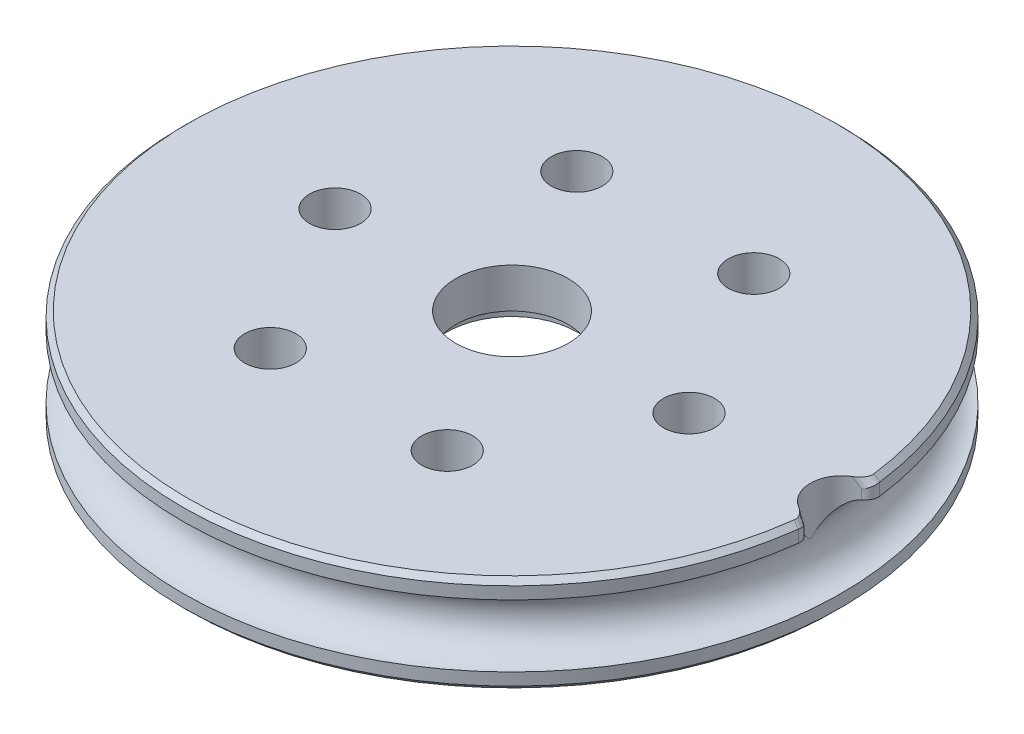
ISO-10303-21;
HEADER;
FILE_DESCRIPTION(('STEP AP214'),'2;1');
FILE_NAME('part.step','',(''),(''),'','','');
FILE_SCHEMA(('AUTOMOTIVE_DESIGN { 1 0 10303 214 1 1 1 1 }'));
ENDSEC;
DATA;
#1=APPLICATION_CONTEXT('core data for automotive mechanical design processes');
#2=APPLICATION_PROTOCOL_DEFINITION('international standard','automotive_design',2000,#1);
#3=PRODUCT_CONTEXT('',#1,'mechanical');
#4=PRODUCT('Part','Part','',(#3));
#5=PRODUCT_RELATED_PRODUCT_CATEGORY('part','',(#4));
#6=PRODUCT_DEFINITION_FORMATION('','',#4);
#7=PRODUCT_DEFINITION_CONTEXT('part definition',#1,'design');
#8=PRODUCT_DEFINITION('design','',#6,#7);
#9=PRODUCT_DEFINITION_SHAPE('','',#8);
#10=(LENGTH_UNIT() NAMED_UNIT(*) SI_UNIT(.MILLI.,.METRE.));
#11=(NAMED_UNIT(*) PLANE_ANGLE_UNIT() SI_UNIT($,.RADIAN.));
#12=(NAMED_UNIT(*) SI_UNIT($,.STERADIAN.) SOLID_ANGLE_UNIT());
#13=UNCERTAINTY_MEASURE_WITH_UNIT(LENGTH_MEASURE(1.E-05),#10,'distance_accuracy_value','');
#14=(GEOMETRIC_REPRESENTATION_CONTEXT(3) GLOBAL_UNCERTAINTY_ASSIGNED_CONTEXT((#13)) GLOBAL_UNIT_ASSIGNED_CONTEXT((#10,
#11,#12)) REPRESENTATION_CONTEXT('',''));
#15=CARTESIAN_POINT('',(0.,0.,0.));
#16=DIRECTION('',(0.,0.,1.));
#17=DIRECTION('',(1.,0.,0.));
#18=AXIS2_PLACEMENT_3D('',#15,#16,#17);
#19=CARTESIAN_POINT('',(0.,4.5,0.));
#20=DIRECTION('',(0.,-1.,0.));
#21=DIRECTION('',(0.,0.,-1.));
#22=AXIS2_PLACEMENT_3D('',#19,#20,#21);
#23=CYLINDRICAL_SURFACE('',#22,32.25);
#24=CARTESIAN_POINT('',(0.,1.7,0.));
#25=DIRECTION('',(0.,1.,0.));
#26=DIRECTION('',(0.,0.,1.));
#27=AXIS2_PLACEMENT_3D('',#24,#25,#26);
#28=CIRCLE('',#27,32.25);
#29=CARTESIAN_POINT('',(0.,1.7,32.25));
#30=VERTEX_POINT('',#29);
#31=EDGE_CURVE('E461',#30,#30,#28,.F.);
#32=ORIENTED_EDGE('',*,*,#31,.T.);
#33=EDGE_LOOP('',(#32));
#34=FACE_BOUND('',#33,.T.);
#35=CARTESIAN_POINT('',(0.,0.500000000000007,0.));
#36=DIRECTION('',(0.,1.,0.));
#37=DIRECTION('',(0.,0.,1.));
#38=AXIS2_PLACEMENT_3D('',#35,#36,#37);
#39=CIRCLE('',#38,32.25);
#40=CARTESIAN_POINT('',(0.,0.500000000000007,32.25));
#41=VERTEX_POINT('',#40);
#42=EDGE_CURVE('E449',#41,#41,#39,.T.);
#43=ORIENTED_EDGE('',*,*,#42,.T.);
#44=EDGE_LOOP('',(#43));
#45=FACE_BOUND('',#44,.T.);
#46=ADVANCED_FACE('F41',(#34,#45),#23,.T.);
#47=CARTESIAN_POINT('',(-15.5833824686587,4.5,-17.5900025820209));
#48=DIRECTION('',(0.,-1.,0.));
#49=DIRECTION('',(0.,0.,-1.));
#50=AXIS2_PLACEMENT_3D('',#47,#48,#49);
#51=CYLINDRICAL_SURFACE('',#50,4.0326913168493);
#52=CARTESIAN_POINT('',(-15.5833824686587,0.,-17.5900025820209));
#53=DIRECTION('',(0.,1.,0.));
#54=DIRECTION('',(0.,0.,1.));
#55=AXIS2_PLACEMENT_3D('',#52,#53,#54);
#56=CIRCLE('',#55,4.0326913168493);
#57=CARTESIAN_POINT('',(-18.9198744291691,0.,-15.3249593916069));
#58=VERTEX_POINT('',#57);
#59=CARTESIAN_POINT('',(-12.9326843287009,0.,-20.629146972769));
#60=VERTEX_POINT('',#59);
#61=EDGE_CURVE('E300',#58,#60,#56,.F.);
#62=ORIENTED_EDGE('',*,*,#61,.T.);
#63=DIRECTION('',(0.,-1.,0.));
#64=VECTOR('',#63,1.);
#65=CARTESIAN_POINT('',(-12.9326843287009,4.5,-20.629146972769));
#66=LINE('',#65,#64);
#67=CARTESIAN_POINT('',(-12.9326843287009,4.5,-20.629146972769));
#68=VERTEX_POINT('',#67);
#69=EDGE_CURVE('E275',#68,#60,#66,.T.);
#70=ORIENTED_EDGE('',*,*,#69,.F.);
#71=CARTESIAN_POINT('',(-15.5833824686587,4.5,-17.5900025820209));
#72=DIRECTION('',(0.,1.,0.));
#73=DIRECTION('',(0.,0.,1.));
#74=AXIS2_PLACEMENT_3D('',#71,#72,#73);
#75=CIRCLE('',#74,4.0326913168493);
#76=CARTESIAN_POINT('',(-18.9198744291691,4.5,-15.3249593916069));
#77=VERTEX_POINT('',#76);
#78=EDGE_CURVE('E268',#77,#68,#75,.F.);
#79=ORIENTED_EDGE('',*,*,#78,.F.);
#80=DIRECTION('',(0.,-1.,0.));
#81=VECTOR('',#80,1.);
#82=CARTESIAN_POINT('',(-18.9198744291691,4.5,-15.3249593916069));
#83=LINE('',#82,#81);
#84=EDGE_CURVE('E272',#77,#58,#83,.T.);
#85=ORIENTED_EDGE('',*,*,#84,.T.);
#86=EDGE_LOOP('',(#62,#70,#79,#85));
#87=FACE_BOUND('',#86,.T.);
#88=ADVANCED_FACE('F271',(#87),#51,.F.);
#89=CARTESIAN_POINT('',(-11.6180793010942,4.5,-22.1364006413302));
#90=DIRECTION('',(0.,-1.,0.));
#91=DIRECTION('',(0.,0.,-1.));
#92=AXIS2_PLACEMENT_3D('',#89,#90,#91);
#93=CYLINDRICAL_SURFACE('',#92,2.);
#94=CARTESIAN_POINT('',(-11.6180793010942,0.,-22.1364006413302));
#95=DIRECTION('',(0.,1.,0.));
#96=DIRECTION('',(0.,0.,1.));
#97=AXIS2_PLACEMENT_3D('',#94,#95,#96);
#98=CIRCLE('',#97,2.);
#99=CARTESIAN_POINT('',(-9.63085307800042,0.,-22.3620816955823));
#100=VERTEX_POINT('',#99);
#101=EDGE_CURVE('E302',#60,#100,#98,.T.);
#102=ORIENTED_EDGE('',*,*,#101,.T.);
#103=DIRECTION('',(0.,-1.,0.));
#104=VECTOR('',#103,1.);
#105=CARTESIAN_POINT('',(-9.63085307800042,4.5,-22.3620816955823));
#106=LINE('',#105,#104);
#107=CARTESIAN_POINT('',(-9.63085307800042,4.5,-22.3620816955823));
#108=VERTEX_POINT('',#107);
#109=EDGE_CURVE('E419',#108,#100,#106,.T.);
#110=ORIENTED_EDGE('',*,*,#109,.F.);
#111=CARTESIAN_POINT('',(-11.6180793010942,4.5,-22.1364006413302));
#112=DIRECTION('',(0.,1.,0.));
#113=DIRECTION('',(0.,0.,1.));
#114=AXIS2_PLACEMENT_3D('',#111,#112,#113);
#115=CIRCLE('',#114,2.);
#116=EDGE_CURVE('E279',#68,#108,#115,.T.);
#117=ORIENTED_EDGE('',*,*,#116,.F.);
#118=ORIENTED_EDGE('',*,*,#69,.T.);
#119=EDGE_LOOP('',(#102,#110,#117,#118));
#120=FACE_BOUND('',#119,.T.);
#121=ADVANCED_FACE('F669',(#120),#93,.T.);
#122=CARTESIAN_POINT('',(-5.62391811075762,4.5,-22.8171327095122));
#123=DIRECTION('',(0.,-1.,0.));
#124=DIRECTION('',(0.,0.,-1.));
#125=AXIS2_PLACEMENT_3D('',#122,#123,#124);
#126=CYLINDRICAL_SURFACE('',#125,4.0326913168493);
#127=CARTESIAN_POINT('',(-5.62391811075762,0.,-22.8171327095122));
#128=DIRECTION('',(0.,1.,0.));
#129=DIRECTION('',(0.,0.,1.));
#130=AXIS2_PLACEMENT_3D('',#127,#128,#129);
#131=CIRCLE('',#130,4.0326913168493);
#132=CARTESIAN_POINT('',(-1.86448064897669,0.,-24.2763205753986));
#133=VERTEX_POINT('',#132);
#134=EDGE_CURVE('E305',#100,#133,#131,.F.);
#135=ORIENTED_EDGE('',*,*,#134,.T.);
#136=DIRECTION('',(0.,-1.,0.));
#137=VECTOR('',#136,1.);
#138=CARTESIAN_POINT('',(-1.86448064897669,4.5,-24.2763205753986));
#139=LINE('',#138,#137);
#140=CARTESIAN_POINT('',(-1.86448064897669,4.5,-24.2763205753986));
#141=VERTEX_POINT('',#140);
#142=EDGE_CURVE('E416',#141,#133,#139,.T.);
#143=ORIENTED_EDGE('',*,*,#142,.F.);
#144=CARTESIAN_POINT('',(-5.62391811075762,4.5,-22.8171327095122));
#145=DIRECTION('',(0.,1.,0.));
#146=DIRECTION('',(0.,0.,1.));
#147=AXIS2_PLACEMENT_3D('',#144,#145,#146);
#148=CIRCLE('',#147,4.0326913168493);
#149=EDGE_CURVE('E762',#108,#141,#148,.F.);
#150=ORIENTED_EDGE('',*,*,#149,.F.);
#151=ORIENTED_EDGE('',*,*,#109,.T.);
#152=EDGE_LOOP('',(#135,#143,#150,#151));
#153=FACE_BOUND('',#152,.T.);
#154=ADVANCED_FACE('F665',(#153),#126,.F.);
#155=CARTESIAN_POINT('',(0.,4.5,-25.));
#156=DIRECTION('',(0.,-1.,0.));
#157=DIRECTION('',(0.,0.,-1.));
#158=AXIS2_PLACEMENT_3D('',#155,#156,#157);
#159=CYLINDRICAL_SURFACE('',#158,2.);
#160=CARTESIAN_POINT('',(0.,0.,-25.));
#161=DIRECTION('',(0.,1.,0.));
#162=DIRECTION('',(0.,0.,1.));
#163=AXIS2_PLACEMENT_3D('',#160,#161,#162);
#164=CIRCLE('',#163,2.);
#165=CARTESIAN_POINT('',(1.86448064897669,0.,-24.2763205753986));
#166=VERTEX_POINT('',#165);
#167=EDGE_CURVE('E307',#133,#166,#164,.T.);
#168=ORIENTED_EDGE('',*,*,#167,.T.);
#169=DIRECTION('',(0.,-1.,0.));
#170=VECTOR('',#169,1.);
#171=CARTESIAN_POINT('',(1.86448064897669,4.5,-24.2763205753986));
#172=LINE('',#171,#170);
#173=CARTESIAN_POINT('',(1.86448064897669,4.5,-24.2763205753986));
#174=VERTEX_POINT('',#173);
#175=EDGE_CURVE('E413',#174,#166,#172,.T.);
#176=ORIENTED_EDGE('',*,*,#175,.F.);
#177=CARTESIAN_POINT('',(0.,4.5,-25.));
#178=DIRECTION('',(0.,1.,0.));
#179=DIRECTION('',(0.,0.,1.));
#180=AXIS2_PLACEMENT_3D('',#177,#178,#179);
#181=CIRCLE('',#180,2.);
#182=EDGE_CURVE('E764',#141,#174,#181,.T.);
#183=ORIENTED_EDGE('',*,*,#182,.F.);
#184=ORIENTED_EDGE('',*,*,#142,.T.);
#185=EDGE_LOOP('',(#168,#176,#183,#184));
#186=FACE_BOUND('',#185,.T.);
#187=ADVANCED_FACE('F661',(#186),#159,.T.);
#188=CARTESIAN_POINT('',(5.62391811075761,4.5,-22.8171327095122));
#189=DIRECTION('',(0.,-1.,0.));
#190=DIRECTION('',(0.,0.,-1.));
#191=AXIS2_PLACEMENT_3D('',#188,#189,#190);
#192=CYLINDRICAL_SURFACE('',#191,4.0326913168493);
#193=CARTESIAN_POINT('',(5.62391811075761,0.,-22.8171327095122));
#194=DIRECTION('',(0.,1.,0.));
#195=DIRECTION('',(0.,0.,1.));
#196=AXIS2_PLACEMENT_3D('',#193,#194,#195);
#197=CIRCLE('',#196,4.0326913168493);
#198=CARTESIAN_POINT('',(9.63085307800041,0.,-22.3620816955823));
#199=VERTEX_POINT('',#198);
#200=EDGE_CURVE('E309',#166,#199,#197,.F.);
#201=ORIENTED_EDGE('',*,*,#200,.T.);
#202=DIRECTION('',(0.,-1.,0.));
#203=VECTOR('',#202,1.);
#204=CARTESIAN_POINT('',(9.63085307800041,4.5,-22.3620816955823));
#205=LINE('',#204,#203);
#206=CARTESIAN_POINT('',(9.63085307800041,4.5,-22.3620816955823));
#207=VERTEX_POINT('',#206);
#208=EDGE_CURVE('E410',#207,#199,#205,.T.);
#209=ORIENTED_EDGE('',*,*,#208,.F.);
#210=CARTESIAN_POINT('',(5.62391811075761,4.5,-22.8171327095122));
#211=DIRECTION('',(0.,1.,0.));
#212=DIRECTION('',(0.,0.,1.));
#213=AXIS2_PLACEMENT_3D('',#210,#211,#212);
#214=CIRCLE('',#213,4.0326913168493);
#215=EDGE_CURVE('E770',#174,#207,#214,.F.);
#216=ORIENTED_EDGE('',*,*,#215,.F.);
#217=ORIENTED_EDGE('',*,*,#175,.T.);
#218=EDGE_LOOP('',(#201,#209,#216,#217));
#219=FACE_BOUND('',#218,.T.);
#220=ADVANCED_FACE('F657',(#219),#192,.F.);
#221=CARTESIAN_POINT('',(11.6180793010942,4.5,-22.1364006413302));
#222=DIRECTION('',(0.,-1.,0.));
#223=DIRECTION('',(0.,0.,-1.));
#224=AXIS2_PLACEMENT_3D('',#221,#222,#223);
#225=CYLINDRICAL_SURFACE('',#224,2.);
#226=CARTESIAN_POINT('',(11.6180793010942,0.,-22.1364006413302));
#227=DIRECTION('',(0.,1.,0.));
#228=DIRECTION('',(0.,0.,1.));
#229=AXIS2_PLACEMENT_3D('',#226,#227,#228);
#230=CIRCLE('',#229,2.);
#231=CARTESIAN_POINT('',(12.9326843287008,0.,-20.629146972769));
#232=VERTEX_POINT('',#231);
#233=EDGE_CURVE('E311',#199,#232,#230,.T.);
#234=ORIENTED_EDGE('',*,*,#233,.T.);
#235=DIRECTION('',(0.,-1.,0.));
#236=VECTOR('',#235,1.);
#237=CARTESIAN_POINT('',(12.9326843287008,4.5,-20.629146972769));
#238=LINE('',#237,#236);
#239=CARTESIAN_POINT('',(12.9326843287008,4.5,-20.629146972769));
#240=VERTEX_POINT('',#239);
#241=EDGE_CURVE('E407',#240,#232,#238,.T.);
#242=ORIENTED_EDGE('',*,*,#241,.F.);
#243=CARTESIAN_POINT('',(11.6180793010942,4.5,-22.1364006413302));
#244=DIRECTION('',(0.,1.,0.));
#245=DIRECTION('',(0.,0.,1.));
#246=AXIS2_PLACEMENT_3D('',#243,#244,#245);
#247=CIRCLE('',#246,2.);
#248=EDGE_CURVE('E773',#207,#240,#247,.T.);
#249=ORIENTED_EDGE('',*,*,#248,.F.);
#250=ORIENTED_EDGE('',*,*,#208,.T.);
#251=EDGE_LOOP('',(#234,#242,#249,#250));
#252=FACE_BOUND('',#251,.T.);
#253=ADVANCED_FACE('F653',(#252),#225,.T.);
#254=CARTESIAN_POINT('',(15.5833824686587,4.5,-17.5900025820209));
#255=DIRECTION('',(0.,-1.,0.));
#256=DIRECTION('',(0.,0.,-1.));
#257=AXIS2_PLACEMENT_3D('',#254,#255,#256);
#258=CYLINDRICAL_SURFACE('',#257,4.0326913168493);
#259=CARTESIAN_POINT('',(15.5833824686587,0.,-17.5900025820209));
#260=DIRECTION('',(0.,1.,0.));
#261=DIRECTION('',(0.,0.,1.));
#262=AXIS2_PLACEMENT_3D('',#259,#260,#261);
#263=CIRCLE('',#262,4.0326913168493);
#264=CARTESIAN_POINT('',(18.9198744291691,0.,-15.3249593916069));
#265=VERTEX_POINT('',#264);
#266=EDGE_CURVE('E313',#232,#265,#263,.F.);
#267=ORIENTED_EDGE('',*,*,#266,.T.);
#268=DIRECTION('',(0.,-1.,0.));
#269=VECTOR('',#268,1.);
#270=CARTESIAN_POINT('',(18.9198744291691,4.5,-15.3249593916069));
#271=LINE('',#270,#269);
#272=CARTESIAN_POINT('',(18.9198744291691,4.5,-15.3249593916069));
#273=VERTEX_POINT('',#272);
#274=EDGE_CURVE('E404',#273,#265,#271,.T.);
#275=ORIENTED_EDGE('',*,*,#274,.F.);
#276=CARTESIAN_POINT('',(15.5833824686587,4.5,-17.5900025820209));
#277=DIRECTION('',(0.,1.,0.));
#278=DIRECTION('',(0.,0.,1.));
#279=AXIS2_PLACEMENT_3D('',#276,#277,#278);
#280=CIRCLE('',#279,4.0326913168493);
#281=EDGE_CURVE('E776',#240,#273,#280,.F.);
#282=ORIENTED_EDGE('',*,*,#281,.F.);
#283=ORIENTED_EDGE('',*,*,#241,.T.);
#284=EDGE_LOOP('',(#267,#275,#282,#283));
#285=FACE_BOUND('',#284,.T.);
#286=ADVANCED_FACE('F649',(#285),#258,.F.);
#287=CARTESIAN_POINT('',(20.5745966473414,4.5,-14.2016186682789));
#288=DIRECTION('',(0.,-1.,0.));
#289=DIRECTION('',(0.,0.,-1.));
#290=AXIS2_PLACEMENT_3D('',#287,#288,#289);
#291=CYLINDRICAL_SURFACE('',#290,2.);
#292=CARTESIAN_POINT('',(20.5745966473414,0.,-14.2016186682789));
#293=DIRECTION('',(0.,1.,0.));
#294=DIRECTION('',(0.,0.,1.));
#295=AXIS2_PLACEMENT_3D('',#292,#293,#294);
#296=CIRCLE('',#295,2.);
#297=CARTESIAN_POINT('',(21.0381658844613,0.,-12.2560844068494));
#298=VERTEX_POINT('',#297);
#299=EDGE_CURVE('E315',#265,#298,#296,.T.);
#300=ORIENTED_EDGE('',*,*,#299,.T.);
#301=DIRECTION('',(0.,-1.,0.));
#302=VECTOR('',#301,1.);
#303=CARTESIAN_POINT('',(21.0381658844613,4.5,-12.2560844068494));
#304=LINE('',#303,#302);
#305=CARTESIAN_POINT('',(21.0381658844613,4.5,-12.2560844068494));
#306=VERTEX_POINT('',#305);
#307=EDGE_CURVE('E401',#306,#298,#304,.T.);
#308=ORIENTED_EDGE('',*,*,#307,.F.);
#309=CARTESIAN_POINT('',(20.5745966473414,4.5,-14.2016186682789));
#310=DIRECTION('',(0.,1.,0.));
#311=DIRECTION('',(0.,0.,1.));
#312=AXIS2_PLACEMENT_3D('',#309,#310,#311);
#313=CIRCLE('',#312,2.);
#314=EDGE_CURVE('E779',#273,#306,#313,.T.);
#315=ORIENTED_EDGE('',*,*,#314,.F.);
#316=ORIENTED_EDGE('',*,*,#274,.T.);
#317=EDGE_LOOP('',(#300,#308,#315,#316));
#318=FACE_BOUND('',#317,.T.);
#319=ADVANCED_FACE('F645',(#318),#291,.T.);
#320=CARTESIAN_POINT('',(21.9728817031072,4.5,-8.33321484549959));
#321=DIRECTION('',(0.,-1.,0.));
#322=DIRECTION('',(0.,0.,-1.));
#323=AXIS2_PLACEMENT_3D('',#320,#321,#322);
#324=CYLINDRICAL_SURFACE('',#323,4.0326913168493);
#325=CARTESIAN_POINT('',(21.9728817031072,0.,-8.33321484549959));
#326=DIRECTION('',(0.,1.,0.));
#327=DIRECTION('',(0.,0.,1.));
#328=AXIS2_PLACEMENT_3D('',#325,#326,#327);
#329=CIRCLE('',#328,4.0326913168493);
#330=CARTESIAN_POINT('',(23.8745805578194,0.,-4.7770735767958));
#331=VERTEX_POINT('',#330);
#332=EDGE_CURVE('E317',#298,#331,#329,.F.);
#333=ORIENTED_EDGE('',*,*,#332,.T.);
#334=DIRECTION('',(0.,-1.,0.));
#335=VECTOR('',#334,1.);
#336=CARTESIAN_POINT('',(23.8745805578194,4.5,-4.7770735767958));
#337=LINE('',#336,#335);
#338=CARTESIAN_POINT('',(23.8745805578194,4.5,-4.7770735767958));
#339=VERTEX_POINT('',#338);
#340=EDGE_CURVE('E398',#339,#331,#337,.T.);
#341=ORIENTED_EDGE('',*,*,#340,.F.);
#342=CARTESIAN_POINT('',(21.9728817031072,4.5,-8.33321484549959));
#343=DIRECTION('',(0.,1.,0.));
#344=DIRECTION('',(0.,0.,1.));
#345=AXIS2_PLACEMENT_3D('',#342,#343,#344);
#346=CIRCLE('',#345,4.0326913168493);
#347=EDGE_CURVE('E782',#306,#339,#346,.F.);
#348=ORIENTED_EDGE('',*,*,#347,.F.);
#349=ORIENTED_EDGE('',*,*,#307,.T.);
#350=EDGE_LOOP('',(#333,#341,#348,#349));
#351=FACE_BOUND('',#350,.T.);
#352=ADVANCED_FACE('F641',(#351),#324,.F.);
#353=CARTESIAN_POINT('',(24.8177218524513,4.5,-3.01341700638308));
#354=DIRECTION('',(0.,-1.,0.));
#355=DIRECTION('',(0.,0.,-1.));
#356=AXIS2_PLACEMENT_3D('',#353,#354,#355);
#357=CYLINDRICAL_SURFACE('',#356,2.);
#358=CARTESIAN_POINT('',(24.8177218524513,0.,-3.01341700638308));
#359=DIRECTION('',(0.,1.,0.));
#360=DIRECTION('',(0.,0.,1.));
#361=AXIS2_PLACEMENT_3D('',#358,#359,#360);
#362=CIRCLE('',#361,2.);
#363=CARTESIAN_POINT('',(24.3240571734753,0.,-1.07530060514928));
#364=VERTEX_POINT('',#363);
#365=EDGE_CURVE('E319',#331,#364,#362,.T.);
#366=ORIENTED_EDGE('',*,*,#365,.T.);
#367=DIRECTION('',(0.,-1.,0.));
#368=VECTOR('',#367,1.);
#369=CARTESIAN_POINT('',(24.3240571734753,4.5,-1.07530060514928));
#370=LINE('',#369,#368);
#371=CARTESIAN_POINT('',(24.3240571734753,4.5,-1.07530060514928));
#372=VERTEX_POINT('',#371);
#373=EDGE_CURVE('E395',#372,#364,#370,.T.);
#374=ORIENTED_EDGE('',*,*,#373,.F.);
#375=CARTESIAN_POINT('',(24.8177218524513,4.5,-3.01341700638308));
#376=DIRECTION('',(0.,1.,0.));
#377=DIRECTION('',(0.,0.,1.));
#378=AXIS2_PLACEMENT_3D('',#375,#376,#377);
#379=CIRCLE('',#378,2.);
#380=EDGE_CURVE('E785',#339,#372,#379,.T.);
#381=ORIENTED_EDGE('',*,*,#380,.F.);
#382=ORIENTED_EDGE('',*,*,#340,.T.);
#383=EDGE_LOOP('',(#366,#374,#381,#382));
#384=FACE_BOUND('',#383,.T.);
#385=ADVANCED_FACE('F637',(#384),#357,.T.);
#386=CARTESIAN_POINT('',(23.3286585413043,4.5,2.83261198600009));
#387=DIRECTION('',(0.,-1.,0.));
#388=DIRECTION('',(0.,0.,-1.));
#389=AXIS2_PLACEMENT_3D('',#386,#387,#388);
#390=CYLINDRICAL_SURFACE('',#389,4.0326913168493);
#391=CARTESIAN_POINT('',(23.3286585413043,0.,2.83261198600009));
#392=DIRECTION('',(0.,1.,0.));
#393=DIRECTION('',(0.,0.,1.));
#394=AXIS2_PLACEMENT_3D('',#391,#392,#393);
#395=CIRCLE('',#394,4.0326913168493);
#396=CARTESIAN_POINT('',(23.3599080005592,0.,6.86518222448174));
#397=VERTEX_POINT('',#396);
#398=EDGE_CURVE('E321',#364,#397,#395,.F.);
#399=ORIENTED_EDGE('',*,*,#398,.T.);
#400=DIRECTION('',(0.,-1.,0.));
#401=VECTOR('',#400,1.);
#402=CARTESIAN_POINT('',(23.3599080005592,4.5,6.86518222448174));
#403=LINE('',#402,#401);
#404=CARTESIAN_POINT('',(23.3599080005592,4.5,6.86518222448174));
#405=VERTEX_POINT('',#404);
#406=EDGE_CURVE('E392',#405,#397,#403,.T.);
#407=ORIENTED_EDGE('',*,*,#406,.F.);
#408=CARTESIAN_POINT('',(23.3286585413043,4.5,2.83261198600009));
#409=DIRECTION('',(0.,1.,0.));
#410=DIRECTION('',(0.,0.,1.));
#411=AXIS2_PLACEMENT_3D('',#408,#409,#410);
#412=CIRCLE('',#411,4.0326913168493);
#413=EDGE_CURVE('E788',#372,#405,#412,.F.);
#414=ORIENTED_EDGE('',*,*,#413,.F.);
#415=ORIENTED_EDGE('',*,*,#373,.T.);
#416=EDGE_LOOP('',(#399,#407,#414,#415));
#417=FACE_BOUND('',#416,.T.);
#418=ADVANCED_FACE('F633',(#417),#390,.F.);
#419=CARTESIAN_POINT('',(23.3754060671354,4.5,8.86512217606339));
#420=DIRECTION('',(0.,-1.,0.));
#421=DIRECTION('',(0.,0.,-1.));
#422=AXIS2_PLACEMENT_3D('',#419,#420,#421);
#423=CYLINDRICAL_SURFACE('',#422,2.);
#424=CARTESIAN_POINT('',(23.3754060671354,0.,8.86512217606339));
#425=DIRECTION('',(0.,1.,0.));
#426=DIRECTION('',(0.,0.,1.));
#427=AXIS2_PLACEMENT_3D('',#424,#425,#426);
#428=CIRCLE('',#427,2.);
#429=CARTESIAN_POINT('',(22.0376001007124,0.,10.3518216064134));
#430=VERTEX_POINT('',#429);
#431=EDGE_CURVE('E323',#397,#430,#428,.T.);
#432=ORIENTED_EDGE('',*,*,#431,.T.);
#433=DIRECTION('',(0.,-1.,0.));
#434=VECTOR('',#433,1.);
#435=CARTESIAN_POINT('',(22.0376001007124,4.5,10.3518216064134));
#436=LINE('',#435,#434);
#437=CARTESIAN_POINT('',(22.0376001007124,4.5,10.3518216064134));
#438=VERTEX_POINT('',#437);
#439=EDGE_CURVE('E389',#438,#430,#436,.T.);
#440=ORIENTED_EDGE('',*,*,#439,.F.);
#441=CARTESIAN_POINT('',(23.3754060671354,4.5,8.86512217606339));
#442=DIRECTION('',(0.,1.,0.));
#443=DIRECTION('',(0.,0.,1.));
#444=AXIS2_PLACEMENT_3D('',#441,#442,#443);
#445=CIRCLE('',#444,2.);
#446=EDGE_CURVE('E791',#405,#438,#445,.T.);
#447=ORIENTED_EDGE('',*,*,#446,.F.);
#448=ORIENTED_EDGE('',*,*,#406,.T.);
#449=EDGE_LOOP('',(#432,#440,#447,#448));
#450=FACE_BOUND('',#449,.T.);
#451=ADVANCED_FACE('F629',(#450),#423,.T.);
#452=CARTESIAN_POINT('',(19.3401208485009,4.5,13.3495215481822));
#453=DIRECTION('',(0.,-1.,0.));
#454=DIRECTION('',(0.,0.,-1.));
#455=AXIS2_PLACEMENT_3D('',#452,#453,#454);
#456=CYLINDRICAL_SURFACE('',#455,4.0326913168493);
#457=CARTESIAN_POINT('',(19.3401208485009,0.,13.3495215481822));
#458=DIRECTION('',(0.,1.,0.));
#459=DIRECTION('',(0.,0.,1.));
#460=AXIS2_PLACEMENT_3D('',#457,#458,#459);
#461=CIRCLE('',#460,4.0326913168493);
#462=CARTESIAN_POINT('',(17.4937620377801,0.,16.9347075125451));
#463=VERTEX_POINT('',#462);
#464=EDGE_CURVE('E325',#430,#463,#461,.F.);
#465=ORIENTED_EDGE('',*,*,#464,.T.);
#466=DIRECTION('',(0.,-1.,0.));
#467=VECTOR('',#466,1.);
#468=CARTESIAN_POINT('',(17.4937620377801,4.5,16.9347075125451));
#469=LINE('',#468,#467);
#470=CARTESIAN_POINT('',(17.4937620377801,4.5,16.9347075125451));
#471=VERTEX_POINT('',#470);
#472=EDGE_CURVE('E386',#471,#463,#469,.T.);
#473=ORIENTED_EDGE('',*,*,#472,.F.);
#474=CARTESIAN_POINT('',(19.3401208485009,4.5,13.3495215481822));
#475=DIRECTION('',(0.,1.,0.));
#476=DIRECTION('',(0.,0.,1.));
#477=AXIS2_PLACEMENT_3D('',#474,#475,#476);
#478=CIRCLE('',#477,4.0326913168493);
#479=EDGE_CURVE('E794',#438,#471,#478,.F.);
#480=ORIENTED_EDGE('',*,*,#479,.F.);
#481=ORIENTED_EDGE('',*,*,#439,.T.);
#482=EDGE_LOOP('',(#465,#473,#480,#481));
#483=FACE_BOUND('',#482,.T.);
#484=ADVANCED_FACE('F625',(#483),#456,.F.);
#485=CARTESIAN_POINT('',(16.5780664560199,4.5,18.7127687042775));
#486=DIRECTION('',(0.,-1.,0.));
#487=DIRECTION('',(0.,0.,-1.));
#488=AXIS2_PLACEMENT_3D('',#485,#486,#487);
#489=CYLINDRICAL_SURFACE('',#488,2.);
#490=CARTESIAN_POINT('',(16.5780664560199,0.,18.7127687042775));
#491=DIRECTION('',(0.,1.,0.));
#492=DIRECTION('',(0.,0.,1.));
#493=AXIS2_PLACEMENT_3D('',#490,#491,#492);
#494=CIRCLE('',#493,2.);
#495=CARTESIAN_POINT('',(14.7025944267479,0.,19.407466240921));
#496=VERTEX_POINT('',#495);
#497=EDGE_CURVE('E327',#463,#496,#494,.T.);
#498=ORIENTED_EDGE('',*,*,#497,.T.);
#499=DIRECTION('',(0.,-1.,0.));
#500=VECTOR('',#499,1.);
#501=CARTESIAN_POINT('',(14.7025944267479,4.5,19.407466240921));
#502=LINE('',#501,#500);
#503=CARTESIAN_POINT('',(14.7025944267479,4.5,19.407466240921));
#504=VERTEX_POINT('',#503);
#505=EDGE_CURVE('E383',#504,#496,#502,.T.);
#506=ORIENTED_EDGE('',*,*,#505,.F.);
#507=CARTESIAN_POINT('',(16.5780664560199,4.5,18.7127687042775));
#508=DIRECTION('',(0.,1.,0.));
#509=DIRECTION('',(0.,0.,1.));
#510=AXIS2_PLACEMENT_3D('',#507,#508,#509);
#511=CIRCLE('',#510,2.);
#512=EDGE_CURVE('E797',#471,#504,#511,.T.);
#513=ORIENTED_EDGE('',*,*,#512,.F.);
#514=ORIENTED_EDGE('',*,*,#472,.T.);
#515=EDGE_LOOP('',(#498,#506,#513,#514));
#516=FACE_BOUND('',#515,.T.);
#517=ADVANCED_FACE('F621',(#516),#489,.T.);
#518=CARTESIAN_POINT('',(10.9209945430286,4.5,20.8082166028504));
#519=DIRECTION('',(0.,-1.,0.));
#520=DIRECTION('',(0.,0.,-1.));
#521=AXIS2_PLACEMENT_3D('',#518,#519,#520);
#522=CYLINDRICAL_SURFACE('',#521,4.0326913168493);
#523=CARTESIAN_POINT('',(10.9209945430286,0.,20.8082166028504));
#524=DIRECTION('',(0.,1.,0.));
#525=DIRECTION('',(0.,0.,1.));
#526=AXIS2_PLACEMENT_3D('',#523,#524,#525);
#527=CIRCLE('',#526,4.0326913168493);
#528=CARTESIAN_POINT('',(7.62000601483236,0.,23.1246953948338));
#529=VERTEX_POINT('',#528);
#530=EDGE_CURVE('E329',#496,#529,#527,.F.);
#531=ORIENTED_EDGE('',*,*,#530,.T.);
#532=DIRECTION('',(0.,-1.,0.));
#533=VECTOR('',#532,1.);
#534=CARTESIAN_POINT('',(7.62000601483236,4.5,23.1246953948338));
#535=LINE('',#534,#533);
#536=CARTESIAN_POINT('',(7.62000601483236,4.5,23.1246953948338));
#537=VERTEX_POINT('',#536);
#538=EDGE_CURVE('E380',#537,#529,#535,.T.);
#539=ORIENTED_EDGE('',*,*,#538,.F.);
#540=CARTESIAN_POINT('',(10.9209945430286,4.5,20.8082166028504));
#541=DIRECTION('',(0.,1.,0.));
#542=DIRECTION('',(0.,0.,1.));
#543=AXIS2_PLACEMENT_3D('',#540,#541,#542);
#544=CIRCLE('',#543,4.0326913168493);
#545=EDGE_CURVE('E800',#504,#537,#544,.F.);
#546=ORIENTED_EDGE('',*,*,#545,.F.);
#547=ORIENTED_EDGE('',*,*,#505,.T.);
#548=EDGE_LOOP('',(#531,#539,#546,#547));
#549=FACE_BOUND('',#548,.T.);
#550=ADVANCED_FACE('F617',(#549),#522,.F.);
#551=CARTESIAN_POINT('',(5.98289160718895,4.5,24.2735454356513));
#552=DIRECTION('',(0.,-1.,0.));
#553=DIRECTION('',(0.,0.,-1.));
#554=AXIS2_PLACEMENT_3D('',#551,#552,#553);
#555=CYLINDRICAL_SURFACE('',#554,2.);
#556=CARTESIAN_POINT('',(5.98289160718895,0.,24.2735454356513));
#557=DIRECTION('',(0.,1.,0.));
#558=DIRECTION('',(0.,0.,1.));
#559=AXIS2_PLACEMENT_3D('',#556,#557,#558);
#560=CIRCLE('',#559,2.);
#561=CARTESIAN_POINT('',(3.99940155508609,0.,24.0170942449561));
#562=VERTEX_POINT('',#561);
#563=EDGE_CURVE('E331',#529,#562,#560,.T.);
#564=ORIENTED_EDGE('',*,*,#563,.T.);
#565=DIRECTION('',(0.,-1.,0.));
#566=VECTOR('',#565,1.);
#567=CARTESIAN_POINT('',(3.99940155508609,4.5,24.0170942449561));
#568=LINE('',#567,#566);
#569=CARTESIAN_POINT('',(3.99940155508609,4.5,24.0170942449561));
#570=VERTEX_POINT('',#569);
#571=EDGE_CURVE('E377',#570,#562,#568,.T.);
#572=ORIENTED_EDGE('',*,*,#571,.F.);
#573=CARTESIAN_POINT('',(5.98289160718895,4.5,24.2735454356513));
#574=DIRECTION('',(0.,1.,0.));
#575=DIRECTION('',(0.,0.,1.));
#576=AXIS2_PLACEMENT_3D('',#573,#574,#575);
#577=CIRCLE('',#576,2.);
#578=EDGE_CURVE('E803',#537,#570,#577,.T.);
#579=ORIENTED_EDGE('',*,*,#578,.F.);
#580=ORIENTED_EDGE('',*,*,#538,.T.);
#581=EDGE_LOOP('',(#564,#572,#579,#580));
#582=FACE_BOUND('',#581,.T.);
#583=ADVANCED_FACE('F613',(#582),#555,.T.);
#584=CARTESIAN_POINT('',(0.,4.5,23.5));
#585=DIRECTION('',(0.,-1.,0.));
#586=DIRECTION('',(0.,0.,-1.));
#587=AXIS2_PLACEMENT_3D('',#584,#585,#586);
#588=CYLINDRICAL_SURFACE('',#587,4.0326913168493);
#589=CARTESIAN_POINT('',(0.,0.,23.5));
#590=DIRECTION('',(0.,1.,0.));
#591=DIRECTION('',(0.,0.,1.));
#592=AXIS2_PLACEMENT_3D('',#589,#590,#591);
#593=CIRCLE('',#592,4.0326913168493);
#594=CARTESIAN_POINT('',(-3.99940155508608,0.,24.0170942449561));
#595=VERTEX_POINT('',#594);
#596=EDGE_CURVE('E333',#562,#595,#593,.F.);
#597=ORIENTED_EDGE('',*,*,#596,.T.);
#598=DIRECTION('',(0.,-1.,0.));
#599=VECTOR('',#598,1.);
#600=CARTESIAN_POINT('',(-3.99940155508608,4.5,24.0170942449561));
#601=LINE('',#600,#599);
#602=CARTESIAN_POINT('',(-3.99940155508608,4.5,24.0170942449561));
#603=VERTEX_POINT('',#602);
#604=EDGE_CURVE('E374',#603,#595,#601,.T.);
#605=ORIENTED_EDGE('',*,*,#604,.F.);
#606=CARTESIAN_POINT('',(0.,4.5,23.5));
#607=DIRECTION('',(0.,1.,0.));
#608=DIRECTION('',(0.,0.,1.));
#609=AXIS2_PLACEMENT_3D('',#606,#607,#608);
#610=CIRCLE('',#609,4.0326913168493);
#611=EDGE_CURVE('E806',#570,#603,#610,.F.);
#612=ORIENTED_EDGE('',*,*,#611,.F.);
#613=ORIENTED_EDGE('',*,*,#571,.T.);
#614=EDGE_LOOP('',(#597,#605,#612,#613));
#615=FACE_BOUND('',#614,.T.);
#616=ADVANCED_FACE('F609',(#615),#588,.F.);
#617=CARTESIAN_POINT('',(-5.98289160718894,4.5,24.2735454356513));
#618=DIRECTION('',(0.,-1.,0.));
#619=DIRECTION('',(0.,0.,-1.));
#620=AXIS2_PLACEMENT_3D('',#617,#618,#619);
#621=CYLINDRICAL_SURFACE('',#620,2.);
#622=CARTESIAN_POINT('',(-5.98289160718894,0.,24.2735454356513));
#623=DIRECTION('',(0.,1.,0.));
#624=DIRECTION('',(0.,0.,1.));
#625=AXIS2_PLACEMENT_3D('',#622,#623,#624);
#626=CIRCLE('',#625,2.);
#627=CARTESIAN_POINT('',(-7.62000601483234,0.,23.1246953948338));
#628=VERTEX_POINT('',#627);
#629=EDGE_CURVE('E335',#595,#628,#626,.T.);
#630=ORIENTED_EDGE('',*,*,#629,.T.);
#631=DIRECTION('',(0.,-1.,0.));
#632=VECTOR('',#631,1.);
#633=CARTESIAN_POINT('',(-7.62000601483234,4.5,23.1246953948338));
#634=LINE('',#633,#632);
#635=CARTESIAN_POINT('',(-7.62000601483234,4.5,23.1246953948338));
#636=VERTEX_POINT('',#635);
#637=EDGE_CURVE('E371',#636,#628,#634,.T.);
#638=ORIENTED_EDGE('',*,*,#637,.F.);
#639=CARTESIAN_POINT('',(-5.98289160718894,4.5,24.2735454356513));
#640=DIRECTION('',(0.,1.,0.));
#641=DIRECTION('',(0.,0.,1.));
#642=AXIS2_PLACEMENT_3D('',#639,#640,#641);
#643=CIRCLE('',#642,2.);
#644=EDGE_CURVE('E809',#603,#636,#643,.T.);
#645=ORIENTED_EDGE('',*,*,#644,.F.);
#646=ORIENTED_EDGE('',*,*,#604,.T.);
#647=EDGE_LOOP('',(#630,#638,#645,#646));
#648=FACE_BOUND('',#647,.T.);
#649=ADVANCED_FACE('F605',(#648),#621,.T.);
#650=CARTESIAN_POINT('',(-10.9209945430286,4.5,20.8082166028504));
#651=DIRECTION('',(0.,-1.,0.));
#652=DIRECTION('',(0.,0.,-1.));
#653=AXIS2_PLACEMENT_3D('',#650,#651,#652);
#654=CYLINDRICAL_SURFACE('',#653,4.0326913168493);
#655=CARTESIAN_POINT('',(-10.9209945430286,0.,20.8082166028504));
#656=DIRECTION('',(0.,1.,0.));
#657=DIRECTION('',(0.,0.,1.));
#658=AXIS2_PLACEMENT_3D('',#655,#656,#657);
#659=CIRCLE('',#658,4.0326913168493);
#660=CARTESIAN_POINT('',(-14.7025944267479,0.,19.407466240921));
#661=VERTEX_POINT('',#660);
#662=EDGE_CURVE('E337',#628,#661,#659,.F.);
#663=ORIENTED_EDGE('',*,*,#662,.T.);
#664=DIRECTION('',(0.,-1.,0.));
#665=VECTOR('',#664,1.);
#666=CARTESIAN_POINT('',(-14.7025944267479,4.5,19.407466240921));
#667=LINE('',#666,#665);
#668=CARTESIAN_POINT('',(-14.7025944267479,4.5,19.407466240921));
#669=VERTEX_POINT('',#668);
#670=EDGE_CURVE('E368',#669,#661,#667,.T.);
#671=ORIENTED_EDGE('',*,*,#670,.F.);
#672=CARTESIAN_POINT('',(-10.9209945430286,4.5,20.8082166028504));
#673=DIRECTION('',(0.,1.,0.));
#674=DIRECTION('',(0.,0.,1.));
#675=AXIS2_PLACEMENT_3D('',#672,#673,#674);
#676=CIRCLE('',#675,4.0326913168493);
#677=EDGE_CURVE('E812',#636,#669,#676,.F.);
#678=ORIENTED_EDGE('',*,*,#677,.F.);
#679=ORIENTED_EDGE('',*,*,#637,.T.);
#680=EDGE_LOOP('',(#663,#671,#678,#679));
#681=FACE_BOUND('',#680,.T.);
#682=ADVANCED_FACE('F601',(#681),#654,.F.);
#683=CARTESIAN_POINT('',(-16.5780664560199,4.5,18.7127687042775));
#684=DIRECTION('',(0.,-1.,0.));
#685=DIRECTION('',(0.,0.,-1.));
#686=AXIS2_PLACEMENT_3D('',#683,#684,#685);
#687=CYLINDRICAL_SURFACE('',#686,2.);
#688=CARTESIAN_POINT('',(-16.5780664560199,0.,18.7127687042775));
#689=DIRECTION('',(0.,1.,0.));
#690=DIRECTION('',(0.,0.,1.));
#691=AXIS2_PLACEMENT_3D('',#688,#689,#690);
#692=CIRCLE('',#691,2.);
#693=CARTESIAN_POINT('',(-17.4937620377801,0.,16.9347075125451));
#694=VERTEX_POINT('',#693);
#695=EDGE_CURVE('E339',#661,#694,#692,.T.);
#696=ORIENTED_EDGE('',*,*,#695,.T.);
#697=DIRECTION('',(0.,-1.,0.));
#698=VECTOR('',#697,1.);
#699=CARTESIAN_POINT('',(-17.4937620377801,4.5,16.9347075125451));
#700=LINE('',#699,#698);
#701=CARTESIAN_POINT('',(-17.4937620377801,4.5,16.9347075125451));
#702=VERTEX_POINT('',#701);
#703=EDGE_CURVE('E365',#702,#694,#700,.T.);
#704=ORIENTED_EDGE('',*,*,#703,.F.);
#705=CARTESIAN_POINT('',(-16.5780664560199,4.5,18.7127687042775));
#706=DIRECTION('',(0.,1.,0.));
#707=DIRECTION('',(0.,0.,1.));
#708=AXIS2_PLACEMENT_3D('',#705,#706,#707);
#709=CIRCLE('',#708,2.);
#710=EDGE_CURVE('E815',#669,#702,#709,.T.);
#711=ORIENTED_EDGE('',*,*,#710,.F.);
#712=ORIENTED_EDGE('',*,*,#670,.T.);
#713=EDGE_LOOP('',(#696,#704,#711,#712));
#714=FACE_BOUND('',#713,.T.);
#715=ADVANCED_FACE('F597',(#714),#687,.T.);
#716=CARTESIAN_POINT('',(-19.3401208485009,4.5,13.3495215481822));
#717=DIRECTION('',(0.,-1.,0.));
#718=DIRECTION('',(0.,0.,-1.));
#719=AXIS2_PLACEMENT_3D('',#716,#717,#718);
#720=CYLINDRICAL_SURFACE('',#719,4.0326913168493);
#721=CARTESIAN_POINT('',(-19.3401208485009,0.,13.3495215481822));
#722=DIRECTION('',(0.,1.,0.));
#723=DIRECTION('',(0.,0.,1.));
#724=AXIS2_PLACEMENT_3D('',#721,#722,#723);
#725=CIRCLE('',#724,4.0326913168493);
#726=CARTESIAN_POINT('',(-22.0376001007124,0.,10.3518216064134));
#727=VERTEX_POINT('',#726);
#728=EDGE_CURVE('E341',#694,#727,#725,.F.);
#729=ORIENTED_EDGE('',*,*,#728,.T.);
#730=DIRECTION('',(0.,-1.,0.));
#731=VECTOR('',#730,1.);
#732=CARTESIAN_POINT('',(-22.0376001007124,4.5,10.3518216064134));
#733=LINE('',#732,#731);
#734=CARTESIAN_POINT('',(-22.0376001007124,4.5,10.3518216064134));
#735=VERTEX_POINT('',#734);
#736=EDGE_CURVE('E362',#735,#727,#733,.T.);
#737=ORIENTED_EDGE('',*,*,#736,.F.);
#738=CARTESIAN_POINT('',(-19.3401208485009,4.5,13.3495215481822));
#739=DIRECTION('',(0.,1.,0.));
#740=DIRECTION('',(0.,0.,1.));
#741=AXIS2_PLACEMENT_3D('',#738,#739,#740);
#742=CIRCLE('',#741,4.0326913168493);
#743=EDGE_CURVE('E818',#702,#735,#742,.F.);
#744=ORIENTED_EDGE('',*,*,#743,.F.);
#745=ORIENTED_EDGE('',*,*,#703,.T.);
#746=EDGE_LOOP('',(#729,#737,#744,#745));
#747=FACE_BOUND('',#746,.T.);
#748=ADVANCED_FACE('F593',(#747),#720,.F.);
#749=CARTESIAN_POINT('',(-23.3754060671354,4.5,8.8651221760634));
#750=DIRECTION('',(0.,-1.,0.));
#751=DIRECTION('',(0.,0.,-1.));
#752=AXIS2_PLACEMENT_3D('',#749,#750,#751);
#753=CYLINDRICAL_SURFACE('',#752,2.);
#754=CARTESIAN_POINT('',(-23.3754060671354,0.,8.8651221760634));
#755=DIRECTION('',(0.,1.,0.));
#756=DIRECTION('',(0.,0.,1.));
#757=AXIS2_PLACEMENT_3D('',#754,#755,#756);
#758=CIRCLE('',#757,2.);
#759=CARTESIAN_POINT('',(-23.3599080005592,0.,6.86518222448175));
#760=VERTEX_POINT('',#759);
#761=EDGE_CURVE('E343',#727,#760,#758,.T.);
#762=ORIENTED_EDGE('',*,*,#761,.T.);
#763=DIRECTION('',(0.,-1.,0.));
#764=VECTOR('',#763,1.);
#765=CARTESIAN_POINT('',(-23.3599080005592,4.5,6.86518222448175));
#766=LINE('',#765,#764);
#767=CARTESIAN_POINT('',(-23.3599080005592,4.5,6.86518222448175));
#768=VERTEX_POINT('',#767);
#769=EDGE_CURVE('E359',#768,#760,#766,.T.);
#770=ORIENTED_EDGE('',*,*,#769,.F.);
#771=CARTESIAN_POINT('',(-23.3754060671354,4.5,8.8651221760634));
#772=DIRECTION('',(0.,1.,0.));
#773=DIRECTION('',(0.,0.,1.));
#774=AXIS2_PLACEMENT_3D('',#771,#772,#773);
#775=CIRCLE('',#774,2.);
#776=EDGE_CURVE('E821',#735,#768,#775,.T.);
#777=ORIENTED_EDGE('',*,*,#776,.F.);
#778=ORIENTED_EDGE('',*,*,#736,.T.);
#779=EDGE_LOOP('',(#762,#770,#777,#778));
#780=FACE_BOUND('',#779,.T.);
#781=ADVANCED_FACE('F589',(#780),#753,.T.);
#782=CARTESIAN_POINT('',(-23.3286585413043,4.5,2.8326119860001));
#783=DIRECTION('',(0.,-1.,0.));
#784=DIRECTION('',(0.,0.,-1.));
#785=AXIS2_PLACEMENT_3D('',#782,#783,#784);
#786=CYLINDRICAL_SURFACE('',#785,4.0326913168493);
#787=CARTESIAN_POINT('',(-23.3286585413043,0.,2.8326119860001));
#788=DIRECTION('',(0.,1.,0.));
#789=DIRECTION('',(0.,0.,1.));
#790=AXIS2_PLACEMENT_3D('',#787,#788,#789);
#791=CIRCLE('',#790,4.0326913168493);
#792=CARTESIAN_POINT('',(-24.3240571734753,0.,-1.07530060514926));
#793=VERTEX_POINT('',#792);
#794=EDGE_CURVE('E345',#760,#793,#791,.F.);
#795=ORIENTED_EDGE('',*,*,#794,.T.);
#796=DIRECTION('',(0.,-1.,0.));
#797=VECTOR('',#796,1.);
#798=CARTESIAN_POINT('',(-24.3240571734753,4.5,-1.07530060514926));
#799=LINE('',#798,#797);
#800=CARTESIAN_POINT('',(-24.3240571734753,4.5,-1.07530060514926));
#801=VERTEX_POINT('',#800);
#802=EDGE_CURVE('E356',#801,#793,#799,.T.);
#803=ORIENTED_EDGE('',*,*,#802,.F.);
#804=CARTESIAN_POINT('',(-23.3286585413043,4.5,2.8326119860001));
#805=DIRECTION('',(0.,1.,0.));
#806=DIRECTION('',(0.,0.,1.));
#807=AXIS2_PLACEMENT_3D('',#804,#805,#806);
#808=CIRCLE('',#807,4.0326913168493);
#809=EDGE_CURVE('E824',#768,#801,#808,.F.);
#810=ORIENTED_EDGE('',*,*,#809,.F.);
#811=ORIENTED_EDGE('',*,*,#769,.T.);
#812=EDGE_LOOP('',(#795,#803,#810,#811));
#813=FACE_BOUND('',#812,.T.);
#814=ADVANCED_FACE('F585',(#813),#786,.F.);
#815=CARTESIAN_POINT('',(-24.8177218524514,4.5,-3.01341700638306));
#816=DIRECTION('',(0.,-1.,0.));
#817=DIRECTION('',(0.,0.,-1.));
#818=AXIS2_PLACEMENT_3D('',#815,#816,#817);
#819=CYLINDRICAL_SURFACE('',#818,2.);
#820=CARTESIAN_POINT('',(-24.8177218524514,0.,-3.01341700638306));
#821=DIRECTION('',(0.,1.,0.));
#822=DIRECTION('',(0.,0.,1.));
#823=AXIS2_PLACEMENT_3D('',#820,#821,#822);
#824=CIRCLE('',#823,2.);
#825=CARTESIAN_POINT('',(-23.8745805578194,0.,-4.77707357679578));
#826=VERTEX_POINT('',#825);
#827=EDGE_CURVE('E347',#793,#826,#824,.T.);
#828=ORIENTED_EDGE('',*,*,#827,.T.);
#829=DIRECTION('',(0.,-1.,0.));
#830=VECTOR('',#829,1.);
#831=CARTESIAN_POINT('',(-23.8745805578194,4.5,-4.77707357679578));
#832=LINE('',#831,#830);
#833=CARTESIAN_POINT('',(-23.8745805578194,4.5,-4.77707357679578));
#834=VERTEX_POINT('',#833);
#835=EDGE_CURVE('E353',#834,#826,#832,.T.);
#836=ORIENTED_EDGE('',*,*,#835,.F.);
#837=CARTESIAN_POINT('',(-24.8177218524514,4.5,-3.01341700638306));
#838=DIRECTION('',(0.,1.,0.));
#839=DIRECTION('',(0.,0.,1.));
#840=AXIS2_PLACEMENT_3D('',#837,#838,#839);
#841=CIRCLE('',#840,2.);
#842=EDGE_CURVE('E296',#801,#834,#841,.T.);
#843=ORIENTED_EDGE('',*,*,#842,.F.);
#844=ORIENTED_EDGE('',*,*,#802,.T.);
#845=EDGE_LOOP('',(#828,#836,#843,#844));
#846=FACE_BOUND('',#845,.T.);
#847=ADVANCED_FACE('F581',(#846),#819,.T.);
#848=CARTESIAN_POINT('',(-21.9728817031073,4.5,-8.33321484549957));
#849=DIRECTION('',(0.,-1.,0.));
#850=DIRECTION('',(0.,0.,-1.));
#851=AXIS2_PLACEMENT_3D('',#848,#849,#850);
#852=CYLINDRICAL_SURFACE('',#851,4.0326913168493);
#853=CARTESIAN_POINT('',(-21.9728817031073,0.,-8.33321484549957));
#854=DIRECTION('',(0.,1.,0.));
#855=DIRECTION('',(0.,0.,1.));
#856=AXIS2_PLACEMENT_3D('',#853,#854,#855);
#857=CIRCLE('',#856,4.0326913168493);
#858=CARTESIAN_POINT('',(-21.0381658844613,0.,-12.2560844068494));
#859=VERTEX_POINT('',#858);
#860=EDGE_CURVE('E349',#826,#859,#857,.F.);
#861=ORIENTED_EDGE('',*,*,#860,.T.);
#862=DIRECTION('',(0.,-1.,0.));
#863=VECTOR('',#862,1.);
#864=CARTESIAN_POINT('',(-21.0381658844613,4.5,-12.2560844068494));
#865=LINE('',#864,#863);
#866=CARTESIAN_POINT('',(-21.0381658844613,4.5,-12.2560844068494));
#867=VERTEX_POINT('',#866);
#868=EDGE_CURVE('E289',#867,#859,#865,.T.);
#869=ORIENTED_EDGE('',*,*,#868,.F.);
#870=CARTESIAN_POINT('',(-21.9728817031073,4.5,-8.33321484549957));
#871=DIRECTION('',(0.,1.,0.));
#872=DIRECTION('',(0.,0.,1.));
#873=AXIS2_PLACEMENT_3D('',#870,#871,#872);
#874=CIRCLE('',#873,4.0326913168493);
#875=EDGE_CURVE('E294',#834,#867,#874,.F.);
#876=ORIENTED_EDGE('',*,*,#875,.F.);
#877=ORIENTED_EDGE('',*,*,#835,.T.);
#878=EDGE_LOOP('',(#861,#869,#876,#877));
#879=FACE_BOUND('',#878,.T.);
#880=ADVANCED_FACE('F578',(#879),#852,.F.);
#881=CARTESIAN_POINT('',(33.2117888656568,7.78254511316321,-4.12887599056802));
#882=CARTESIAN_POINT('',(33.2446153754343,7.89018812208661,-2.9923040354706));
#883=CARTESIAN_POINT('',(32.445865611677,7.07543833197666,-3.04370443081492));
#884=CARTESIAN_POINT('',(33.0860229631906,7.90628858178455,-4.13744629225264));
#885=CARTESIAN_POINT('',(33.1380376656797,7.99286695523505,-3.02380514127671));
#886=CARTESIAN_POINT('',(32.3512002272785,7.19918180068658,-3.04977937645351));
#887=CARTESIAN_POINT('',(32.9604927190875,8.03051926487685,-4.14003966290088));
#888=CARTESIAN_POINT('',(33.0288545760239,8.09854313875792,-3.04998554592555));
#889=CARTESIAN_POINT('',(32.2567014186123,7.32341248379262,-3.05144302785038));
#890=CARTESIAN_POINT('',(32.7103545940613,8.2795269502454,-4.13339947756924));
#891=CARTESIAN_POINT('',(32.808826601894,8.31259519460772,-3.09036104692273));
#892=CARTESIAN_POINT('',(32.0683754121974,7.57242016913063,-3.04604841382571));
#893=CARTESIAN_POINT('',(32.585746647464,8.40430391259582,-4.12416677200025));
#894=CARTESIAN_POINT('',(32.6979732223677,8.42095485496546,-3.10483546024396));
#895=CARTESIAN_POINT('',(31.9745481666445,7.69719713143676,-3.03899077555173));
#896=CARTESIAN_POINT('',(32.218482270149,8.77427891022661,-4.07947135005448));
#897=CARTESIAN_POINT('',(32.37158468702,8.74169634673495,-3.12969717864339));
#898=CARTESIAN_POINT('',(31.6979699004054,8.06717212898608,-3.00530248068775));
#899=CARTESIAN_POINT('',(31.9777605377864,9.01967128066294,-4.02730725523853));
#900=CARTESIAN_POINT('',(32.1511871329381,8.96036317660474,-3.1246740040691));
#901=CARTESIAN_POINT('',(31.5166412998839,8.31256449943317,-2.96636520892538));
#902=CARTESIAN_POINT('',(31.626854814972,9.38164128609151,-3.91595541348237));
#903=CARTESIAN_POINT('',(31.8229616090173,9.28956911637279,-3.08135564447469));
#904=CARTESIAN_POINT('',(31.2522409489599,8.67453450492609,-2.88361683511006));
#905=CARTESIAN_POINT('',(31.5128420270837,9.49994662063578,-3.87398755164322));
#906=CARTESIAN_POINT('',(31.7166539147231,9.396732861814,-3.0619011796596));
#907=CARTESIAN_POINT('',(31.1663225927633,8.79283983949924,-2.85247074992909));
#908=CARTESIAN_POINT('',(31.2876518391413,9.73497190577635,-3.77901865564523));
#909=CARTESIAN_POINT('',(31.5056283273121,9.61056560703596,-3.01170627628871));
#910=CARTESIAN_POINT('',(30.9965984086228,9.02786512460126,-2.78207109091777));
#911=CARTESIAN_POINT('',(31.1764738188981,9.85169220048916,-3.72602005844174));
#912=CARTESIAN_POINT('',(31.40083077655,9.7172955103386,-2.98115394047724));
#913=CARTESIAN_POINT('',(30.9127921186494,9.14458541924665,-2.74281930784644));
#914=CARTESIAN_POINT('',(30.9556108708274,10.0849071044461,-3.6076803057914));
#915=CARTESIAN_POINT('',(31.1917882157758,9.93130328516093,-2.90791341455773));
#916=CARTESIAN_POINT('',(30.7462803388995,9.3778003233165,-2.65524829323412));
#917=CARTESIAN_POINT('',(30.8459866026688,10.2013616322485,-3.5421384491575));
#918=CARTESIAN_POINT('',(31.087453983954,10.0386729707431,-2.86518872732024));
#919=CARTESIAN_POINT('',(30.6636201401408,9.49425485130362,-2.60678171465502));
#920=CARTESIAN_POINT('',(30.630963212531,10.4310978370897,-3.39884220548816));
#921=CARTESIAN_POINT('',(30.8821059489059,10.2510911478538,-2.76745347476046));
#922=CARTESIAN_POINT('',(30.5014606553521,9.7239910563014,-2.50089034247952));
#923=CARTESIAN_POINT('',(30.5255672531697,10.5443771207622,-3.32107888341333));
#924=CARTESIAN_POINT('',(30.7809732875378,10.3562456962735,-2.71259670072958));
#925=CARTESIAN_POINT('',(30.4219637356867,9.83727033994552,-2.44345899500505));
#926=CARTESIAN_POINT('',(30.422709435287,10.6555653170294,-3.2370023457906));
#927=CARTESIAN_POINT('',(30.681213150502,10.4605191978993,-2.65094850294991));
#928=CARTESIAN_POINT('',(30.3443687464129,9.94845853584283,-2.38140074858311));
#929=(BOUNDED_SURFACE() B_SPLINE_SURFACE(3,2,((#881,#882,#883),(#884,#885,#886),(#887,#888,
#889),(#890,#891,#892),(#893,#894,#895),(#896,#897,#898),(#899,#900,#901),(#902,#903,#904),
(#905,#906,#907),(#908,#909,#910),(#911,#912,#913),(#914,#915,#916),(#917,#918,#919),(#920,#921,
#922),(#923,#924,#925),(#926,#927,#928)),.UNSPECIFIED.,.F.,.F.,
.F.) B_SPLINE_SURFACE_WITH_KNOTS((4,2,2,2,2,2,2,4),(3,3),(0.,0.529465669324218,1.05889326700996,
2.09841063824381,2.60656825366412,3.11461372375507,3.63159541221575,4.1489568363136),(0.,1.),
.UNSPECIFIED.) GEOMETRIC_REPRESENTATION_ITEM() RATIONAL_B_SPLINE_SURFACE(((1.,0.658742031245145,
1.),(1.,0.666751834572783,1.),(1.,0.674691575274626,1.),(1.,0.690423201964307,1.),(1.,
0.698215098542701,1.),(1.,0.721077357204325,1.),(1.,0.735927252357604,1.),(1.,0.75746871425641,
1.),(1.,0.76445044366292,1.),(1.,0.778217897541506,1.),(1.,0.785003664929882,1.),(1.,
0.798472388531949,1.),(1.,0.805151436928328,1.),(1.,0.818249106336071,1.),(1.,0.824667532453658,
1.),(1.,0.830934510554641,1.))) REPRESENTATION_ITEM('') SURFACE());
#930=CARTESIAN_POINT('',(31.9979226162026,8.99999999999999,-4.02435687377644));
#931=CARTESIAN_POINT('',(31.9988684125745,9.00000443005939,-4.01683674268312));
#932=CARTESIAN_POINT('',(31.9998110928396,8.99988798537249,-4.00932003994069));
#933=CARTESIAN_POINT('',(32.0016902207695,8.99941334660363,-3.99429349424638));
#934=CARTESIAN_POINT('',(32.0026266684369,8.99905515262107,-3.98678365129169));
#935=CARTESIAN_POINT('',(32.00356,8.99857608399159,-3.97927723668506));
#936=B_SPLINE_CURVE_WITH_KNOTS('',3,(#930,#931,#932,#933,#934,#935),.UNSPECIFIED.,.F.,.F.,(4,2,
4),(0.,0.0227294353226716,0.0454588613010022),.UNSPECIFIED.);
#937=CARTESIAN_POINT('',(31.9979226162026,8.99999999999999,-4.02435687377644));
#938=VERTEX_POINT('',#937);
#939=CARTESIAN_POINT('',(32.00356,8.99857608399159,-3.97927723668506));
#940=VERTEX_POINT('',#939);
#941=EDGE_CURVE('E682',#938,#940,#936,.T.);
#942=ORIENTED_EDGE('',*,*,#941,.T.);
#943=DIRECTION('',(0.,-1.,0.));
#944=VECTOR('',#943,1.);
#945=CARTESIAN_POINT('',(32.00356,4.5,-3.97927723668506));
#946=LINE('',#945,#944);
#947=CARTESIAN_POINT('',(32.00356,7.8,-3.97927723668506));
#948=VERTEX_POINT('',#947);
#949=EDGE_CURVE('E688',#940,#948,#946,.T.);
#950=ORIENTED_EDGE('',*,*,#949,.T.);
#951=CARTESIAN_POINT('',(0.,7.8,0.));
#952=DIRECTION('',(0.,-1.,0.));
#953=DIRECTION('',(0.,0.,-1.));
#954=AXIS2_PLACEMENT_3D('',#951,#952,#953);
#955=CIRCLE('',#954,32.25);
#956=CARTESIAN_POINT('',(32.00356,7.8,3.97927723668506));
#957=VERTEX_POINT('',#956);
#958=EDGE_CURVE('E458',#948,#957,#955,.F.);
#959=ORIENTED_EDGE('',*,*,#958,.T.);
#960=DIRECTION('',(0.,-1.,0.));
#961=VECTOR('',#960,1.);
#962=CARTESIAN_POINT('',(32.00356,4.5,3.97927723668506));
#963=LINE('',#962,#961);
#964=CARTESIAN_POINT('',(32.00356,8.99857608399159,3.97927723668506));
#965=VERTEX_POINT('',#964);
#966=EDGE_CURVE('E689',#957,#965,#963,.F.);
#967=ORIENTED_EDGE('',*,*,#966,.T.);
#968=CARTESIAN_POINT('',(32.445865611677,7.07543833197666,3.04370443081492));
#969=CARTESIAN_POINT('',(33.2446153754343,7.89018812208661,2.9923040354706));
#970=CARTESIAN_POINT('',(33.2117888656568,7.78254511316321,4.12887599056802));
#971=CARTESIAN_POINT('',(32.3512002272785,7.19918180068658,3.04977937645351));
#972=CARTESIAN_POINT('',(33.1380376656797,7.99286695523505,3.02380514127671));
#973=CARTESIAN_POINT('',(33.0860229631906,7.90628858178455,4.13744629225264));
#974=CARTESIAN_POINT('',(32.2567014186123,7.32341248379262,3.05144302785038));
#975=CARTESIAN_POINT('',(33.0288545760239,8.09854313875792,3.04998554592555));
#976=CARTESIAN_POINT('',(32.9604927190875,8.03051926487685,4.14003966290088));
#977=CARTESIAN_POINT('',(32.0683754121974,7.57242016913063,3.04604841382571));
#978=CARTESIAN_POINT('',(32.808826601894,8.31259519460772,3.09036104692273));
#979=CARTESIAN_POINT('',(32.7103545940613,8.2795269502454,4.13339947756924));
#980=CARTESIAN_POINT('',(31.9745481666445,7.69719713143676,3.03899077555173));
#981=CARTESIAN_POINT('',(32.6979732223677,8.42095485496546,3.10483546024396));
#982=CARTESIAN_POINT('',(32.585746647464,8.40430391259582,4.12416677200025));
#983=CARTESIAN_POINT('',(31.6979699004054,8.06717212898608,3.00530248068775));
#984=CARTESIAN_POINT('',(32.37158468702,8.74169634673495,3.12969717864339));
#985=CARTESIAN_POINT('',(32.218482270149,8.77427891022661,4.07947135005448));
#986=CARTESIAN_POINT('',(31.5166412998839,8.31256449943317,2.96636520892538));
#987=CARTESIAN_POINT('',(32.1511871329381,8.96036317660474,3.1246740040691));
#988=CARTESIAN_POINT('',(31.9777605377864,9.01967128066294,4.02730725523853));
#989=CARTESIAN_POINT('',(31.2522409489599,8.67453450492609,2.88361683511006));
#990=CARTESIAN_POINT('',(31.8229616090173,9.28956911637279,3.08135564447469));
#991=CARTESIAN_POINT('',(31.626854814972,9.38164128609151,3.91595541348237));
#992=CARTESIAN_POINT('',(31.1663225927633,8.79283983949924,2.85247074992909));
#993=CARTESIAN_POINT('',(31.7166539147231,9.396732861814,3.0619011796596));
#994=CARTESIAN_POINT('',(31.5128420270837,9.49994662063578,3.87398755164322));
#995=CARTESIAN_POINT('',(30.9965984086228,9.02786512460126,2.78207109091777));
#996=CARTESIAN_POINT('',(31.5056283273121,9.61056560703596,3.01170627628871));
#997=CARTESIAN_POINT('',(31.2876518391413,9.73497190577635,3.77901865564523));
#998=CARTESIAN_POINT('',(30.9127921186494,9.14458541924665,2.74281930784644));
#999=CARTESIAN_POINT('',(31.40083077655,9.7172955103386,2.98115394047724));
#1000=CARTESIAN_POINT('',(31.1764738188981,9.85169220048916,3.72602005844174));
#1001=CARTESIAN_POINT('',(30.7462803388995,9.3778003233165,2.65524829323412));
#1002=CARTESIAN_POINT('',(31.1917882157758,9.93130328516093,2.90791341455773));
#1003=CARTESIAN_POINT('',(30.9556108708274,10.0849071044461,3.6076803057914));
#1004=CARTESIAN_POINT('',(30.6636201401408,9.49425485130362,2.60678171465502));
#1005=CARTESIAN_POINT('',(31.087453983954,10.0386729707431,2.86518872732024));
#1006=CARTESIAN_POINT('',(30.8459866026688,10.2013616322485,3.5421384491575));
#1007=CARTESIAN_POINT('',(30.5014606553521,9.7239910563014,2.50089034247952));
#1008=CARTESIAN_POINT('',(30.8821059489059,10.2510911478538,2.76745347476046));
#1009=CARTESIAN_POINT('',(30.630963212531,10.4310978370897,3.39884220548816));
#1010=CARTESIAN_POINT('',(30.4219637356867,9.83727033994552,2.44345899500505));
#1011=CARTESIAN_POINT('',(30.7809732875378,10.3562456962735,2.71259670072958));
#1012=CARTESIAN_POINT('',(30.5255672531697,10.5443771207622,3.32107888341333));
#1013=CARTESIAN_POINT('',(30.3443687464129,9.94845853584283,2.38140074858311));
#1014=CARTESIAN_POINT('',(30.681213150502,10.4605191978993,2.65094850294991));
#1015=CARTESIAN_POINT('',(30.422709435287,10.6555653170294,3.2370023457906));
#1016=(BOUNDED_SURFACE() B_SPLINE_SURFACE(3,2,((#968,#969,#970),(#971,#972,#973),(#974,#975,
#976),(#977,#978,#979),(#980,#981,#982),(#983,#984,#985),(#986,#987,#988),(#989,#990,#991),
(#992,#993,#994),(#995,#996,#997),(#998,#999,#1000),(#1001,#1002,#1003),(#1004,#1005,#1006),
(#1007,#1008,#1009),(#1010,#1011,#1012),(#1013,#1014,#1015)),.UNSPECIFIED.,.F.,.F.,
.F.) B_SPLINE_SURFACE_WITH_KNOTS((4,2,2,2,2,2,2,4),(3,3),(0.,0.529465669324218,1.05889326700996,
2.09841063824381,2.60656825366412,3.11461372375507,3.63159541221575,4.1489568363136),(0.,1.),
.UNSPECIFIED.) GEOMETRIC_REPRESENTATION_ITEM() RATIONAL_B_SPLINE_SURFACE(((1.,0.658742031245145,
1.),(1.,0.666751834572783,1.),(1.,0.674691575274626,1.),(1.,0.690423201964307,1.),(1.,
0.698215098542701,1.),(1.,0.721077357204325,1.),(1.,0.735927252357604,1.),(1.,0.75746871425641,
1.),(1.,0.76445044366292,1.),(1.,0.778217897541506,1.),(1.,0.785003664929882,1.),(1.,
0.798472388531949,1.),(1.,0.805151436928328,1.),(1.,0.818249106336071,1.),(1.,0.824667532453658,
1.),(1.,0.830934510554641,1.))) REPRESENTATION_ITEM('') SURFACE());
#1017=CARTESIAN_POINT('',(32.00356,8.99857608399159,3.97927723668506));
#1018=CARTESIAN_POINT('',(32.0026266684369,8.99905515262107,3.98678365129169));
#1019=CARTESIAN_POINT('',(32.0016902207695,8.99941334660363,3.99429349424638));
#1020=CARTESIAN_POINT('',(31.9998110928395,8.99988798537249,4.00932003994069));
#1021=CARTESIAN_POINT('',(31.9988684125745,9.00000443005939,4.01683674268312));
#1022=CARTESIAN_POINT('',(31.9979226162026,9.,4.02435687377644));
#1023=B_SPLINE_CURVE_WITH_KNOTS('',3,(#1017,#1018,#1019,#1020,#1021,#1022),.UNSPECIFIED.,.F.,
.F.,(4,2,4),(0.,0.0227294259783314,0.0454588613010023),.UNSPECIFIED.);
#1024=CARTESIAN_POINT('',(31.9979226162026,8.99999999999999,4.02435687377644));
#1025=VERTEX_POINT('',#1024);
#1026=EDGE_CURVE('E474',#965,#1025,#1023,.T.);
#1027=ORIENTED_EDGE('',*,*,#1026,.T.);
#1028=CARTESIAN_POINT('',(0.,8.99999999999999,0.));
#1029=DIRECTION('',(0.,1.,0.));
#1030=DIRECTION('',(0.,0.,1.));
#1031=AXIS2_PLACEMENT_3D('',#1028,#1029,#1030);
#1032=CIRCLE('',#1031,32.25);
#1033=EDGE_CURVE('E423',#1025,#938,#1032,.F.);
#1034=ORIENTED_EDGE('',*,*,#1033,.T.);
#1035=EDGE_LOOP('',(#942,#950,#959,#967,#1027,#1034));
#1036=FACE_BOUND('',#1035,.T.);
#1037=ADVANCED_FACE('F577',(#1036),#23,.T.);
#1038=CARTESIAN_POINT('',(-20.5745966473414,4.5,-14.2016186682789));
#1039=DIRECTION('',(0.,-1.,0.));
#1040=DIRECTION('',(0.,0.,-1.));
#1041=AXIS2_PLACEMENT_3D('',#1038,#1039,#1040);
#1042=CYLINDRICAL_SURFACE('',#1041,2.);
#1043=CARTESIAN_POINT('',(-20.5745966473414,0.,-14.2016186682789));
#1044=DIRECTION('',(0.,1.,0.));
#1045=DIRECTION('',(0.,0.,1.));
#1046=AXIS2_PLACEMENT_3D('',#1043,#1044,#1045);
#1047=CIRCLE('',#1046,2.);
#1048=EDGE_CURVE('E280',#859,#58,#1047,.T.);
#1049=ORIENTED_EDGE('',*,*,#1048,.T.);
#1050=ORIENTED_EDGE('',*,*,#84,.F.);
#1051=CARTESIAN_POINT('',(-20.5745966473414,4.5,-14.2016186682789));
#1052=DIRECTION('',(0.,1.,0.));
#1053=DIRECTION('',(0.,0.,1.));
#1054=AXIS2_PLACEMENT_3D('',#1051,#1052,#1053);
#1055=CIRCLE('',#1054,2.);
#1056=EDGE_CURVE('E286',#867,#77,#1055,.T.);
#1057=ORIENTED_EDGE('',*,*,#1056,.F.);
#1058=ORIENTED_EDGE('',*,*,#868,.T.);
#1059=EDGE_LOOP('',(#1049,#1050,#1057,#1058));
#1060=FACE_BOUND('',#1059,.T.);
#1061=ADVANCED_FACE('F284',(#1060),#1042,.T.);
#1062=CARTESIAN_POINT('',(0.,0.,0.));
#1063=DIRECTION('',(0.,1.,0.));
#1064=DIRECTION('',(0.,0.,1.));
#1065=AXIS2_PLACEMENT_3D('',#1062,#1063,#1064);
#1066=PLANE('',#1065);
#1067=CARTESIAN_POINT('',(0.,0.,0.));
#1068=DIRECTION('',(0.,1.,0.));
#1069=DIRECTION('',(0.,0.,1.));
#1070=AXIS2_PLACEMENT_3D('',#1067,#1068,#1069);
#1071=CIRCLE('',#1070,31.75);
#1072=CARTESIAN_POINT('',(0.,0.,31.75));
#1073=VERTEX_POINT('',#1072);
#1074=EDGE_CURVE('E452',#1073,#1073,#1071,.F.);
#1075=ORIENTED_EDGE('',*,*,#1074,.T.);
#1076=EDGE_LOOP('',(#1075));
#1077=FACE_BOUND('',#1076,.T.);
#1078=ORIENTED_EDGE('',*,*,#61,.F.);
#1079=ORIENTED_EDGE('',*,*,#1048,.F.);
#1080=ORIENTED_EDGE('',*,*,#860,.F.);
#1081=ORIENTED_EDGE('',*,*,#827,.F.);
#1082=ORIENTED_EDGE('',*,*,#794,.F.);
#1083=ORIENTED_EDGE('',*,*,#761,.F.);
#1084=ORIENTED_EDGE('',*,*,#728,.F.);
#1085=ORIENTED_EDGE('',*,*,#695,.F.);
#1086=ORIENTED_EDGE('',*,*,#662,.F.);
#1087=ORIENTED_EDGE('',*,*,#629,.F.);
#1088=ORIENTED_EDGE('',*,*,#596,.F.);
#1089=ORIENTED_EDGE('',*,*,#563,.F.);
#1090=ORIENTED_EDGE('',*,*,#530,.F.);
#1091=ORIENTED_EDGE('',*,*,#497,.F.);
#1092=ORIENTED_EDGE('',*,*,#464,.F.);
#1093=ORIENTED_EDGE('',*,*,#431,.F.);
#1094=ORIENTED_EDGE('',*,*,#398,.F.);
#1095=ORIENTED_EDGE('',*,*,#365,.F.);
#1096=ORIENTED_EDGE('',*,*,#332,.F.);
#1097=ORIENTED_EDGE('',*,*,#299,.F.);
#1098=ORIENTED_EDGE('',*,*,#266,.F.);
#1099=ORIENTED_EDGE('',*,*,#233,.F.);
#1100=ORIENTED_EDGE('',*,*,#200,.F.);
#1101=ORIENTED_EDGE('',*,*,#167,.F.);
#1102=ORIENTED_EDGE('',*,*,#134,.F.);
#1103=ORIENTED_EDGE('',*,*,#101,.F.);
#1104=EDGE_LOOP('',(#1078,#1079,#1080,#1081,#1082,#1083,#1084,#1085,#1086,#1087,#1088,#1089,
#1090,#1091,#1092,#1093,#1094,#1095,#1096,#1097,#1098,#1099,#1100,#1101,#1102,#1103));
#1105=FACE_BOUND('',#1104,.T.);
#1106=ADVANCED_FACE('F565',(#1077,#1105),#1066,.F.);
#1107=CARTESIAN_POINT('',(0.,9.5,0.));
#1108=DIRECTION('',(0.,1.,0.));
#1109=DIRECTION('',(0.,0.,1.));
#1110=AXIS2_PLACEMENT_3D('',#1107,#1108,#1109);
#1111=PLANE('',#1110);
#1112=CARTESIAN_POINT('',(32.25,9.5,0.));
#1113=DIRECTION('',(0.,1.,0.));
#1114=DIRECTION('',(0.,0.,1.));
#1115=AXIS2_PLACEMENT_3D('',#1112,#1113,#1114);
#1116=CIRCLE('',#1115,3.05);
#1117=CARTESIAN_POINT('',(30.6597026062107,9.5,-2.60258605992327));
#1118=VERTEX_POINT('',#1117);
#1119=CARTESIAN_POINT('',(30.6597026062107,9.5,2.60258605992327));
#1120=VERTEX_POINT('',#1119);
#1121=EDGE_CURVE('E706',#1118,#1120,#1116,.T.);
#1122=ORIENTED_EDGE('',*,*,#1121,.F.);
#1123=CARTESIAN_POINT('',(30.6597026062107,9.5,-2.60258605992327));
#1124=CARTESIAN_POINT('',(30.7182814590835,9.5,-2.63844008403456));
#1125=CARTESIAN_POINT('',(30.7756021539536,9.5,-2.67644679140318));
#1126=CARTESIAN_POINT('',(30.8872858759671,9.5,-2.75718518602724));
#1127=CARTESIAN_POINT('',(30.9416308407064,9.5,-2.79994178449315));
#1128=CARTESIAN_POINT('',(31.0471018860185,9.5,-2.89093592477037));
#1129=CARTESIAN_POINT('',(31.0981619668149,9.5,-2.93925070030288));
#1130=CARTESIAN_POINT('',(31.1946896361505,9.5,-3.04102211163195));
#1131=CARTESIAN_POINT('',(31.240171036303,9.5,-3.09446543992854));
#1132=CARTESIAN_POINT('',(31.3165438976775,9.5,-3.19716854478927));
#1133=CARTESIAN_POINT('',(31.3485984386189,9.5,-3.24555550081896));
#1134=CARTESIAN_POINT('',(31.4060874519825,9.5,-3.34609048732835));
#1135=CARTESIAN_POINT('',(31.4315324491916,9.5,-3.3982323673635));
#1136=CARTESIAN_POINT('',(31.4741758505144,9.5,-3.50681406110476));
#1137=CARTESIAN_POINT('',(31.4912391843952,9.5,-3.56330830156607));
#1138=CARTESIAN_POINT('',(31.5138847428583,9.5,-3.67849207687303));
#1139=CARTESIAN_POINT('',(31.5195240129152,9.5,-3.73716920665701));
#1140=CARTESIAN_POINT('',(31.5181543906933,9.5,-3.80838204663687));
#1141=CARTESIAN_POINT('',(31.5175854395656,9.5,-3.82114610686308));
#1142=CARTESIAN_POINT('',(31.515791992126,9.5,-3.84663074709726));
#1143=CARTESIAN_POINT('',(31.5145673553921,9.5,-3.85935131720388));
#1144=CARTESIAN_POINT('',(31.5130104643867,9.5,-3.8720371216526));
#1145=B_SPLINE_CURVE_WITH_KNOTS('',3,(#1123,#1124,#1125,#1126,#1127,#1128,#1129,#1130,#1131,
#1132,#1133,#1134,#1135,#1136,#1137,#1138,#1139,#1140,#1141,#1142,#1143,#1144),.UNSPECIFIED.,
.F.,.F.,(4,2,2,2,2,2,2,2,2,2,4),(0.,0.206071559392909,0.413280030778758,0.623828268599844,
0.833844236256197,1.00757048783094,1.18101838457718,1.35717650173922,1.53245279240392,
1.570771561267,1.60909853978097),.UNSPECIFIED.);
#1146=CARTESIAN_POINT('',(31.5130104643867,9.5,-3.8720371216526));
#1147=VERTEX_POINT('',#1146);
#1148=EDGE_CURVE('E70',#1118,#1147,#1145,.T.);
#1149=ORIENTED_EDGE('',*,*,#1148,.T.);
#1150=CARTESIAN_POINT('',(0.,9.5,0.));
#1151=DIRECTION('',(0.,1.,0.));
#1152=DIRECTION('',(0.,0.,1.));
#1153=AXIS2_PLACEMENT_3D('',#1150,#1151,#1152);
#1154=CIRCLE('',#1153,31.75);
#1155=CARTESIAN_POINT('',(31.5130104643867,9.5,3.8720371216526));
#1156=VERTEX_POINT('',#1155);
#1157=EDGE_CURVE('E455',#1147,#1156,#1154,.T.);
#1158=ORIENTED_EDGE('',*,*,#1157,.T.);
#1159=CARTESIAN_POINT('',(31.5130104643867,9.5,3.8720371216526));
#1160=CARTESIAN_POINT('',(31.5161509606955,9.5,3.84652619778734));
#1161=CARTESIAN_POINT('',(31.5179256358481,9.5,3.82087344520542));
#1162=CARTESIAN_POINT('',(31.5188886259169,9.5,3.76956576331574));
#1163=CARTESIAN_POINT('',(31.5180818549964,9.5,3.74391093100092));
#1164=CARTESIAN_POINT('',(31.512072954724,9.5,3.66793512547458));
#1165=CARTESIAN_POINT('',(31.5033610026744,9.5,3.6178747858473));
#1166=CARTESIAN_POINT('',(31.4751047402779,9.5,3.50838146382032));
#1167=CARTESIAN_POINT('',(31.4535004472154,9.5,3.44950106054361));
#1168=CARTESIAN_POINT('',(31.4011038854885,9.5,3.33571405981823));
#1169=CARTESIAN_POINT('',(31.3702577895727,9.5,3.28083315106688));
#1170=CARTESIAN_POINT('',(31.2829203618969,9.5,3.14662326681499));
#1171=CARTESIAN_POINT('',(31.2216513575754,9.5,3.07043311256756));
#1172=CARTESIAN_POINT('',(31.0884707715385,9.5,2.92816658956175));
#1173=CARTESIAN_POINT('',(31.0165435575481,9.5,2.86210537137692));
#1174=CARTESIAN_POINT('',(30.8962278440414,9.5,2.7644068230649));
#1175=CARTESIAN_POINT('',(30.8502451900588,9.5,2.72974153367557));
#1176=CARTESIAN_POINT('',(30.7563694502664,9.5,2.66376102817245));
#1177=CARTESIAN_POINT('',(30.7084904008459,9.5,2.63242587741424));
#1178=CARTESIAN_POINT('',(30.6597026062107,9.5,2.60258605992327));
#1179=B_SPLINE_CURVE_WITH_KNOTS('',3,(#1159,#1160,#1161,#1162,#1163,#1164,#1165,#1166,#1167,
#1168,#1169,#1170,#1171,#1172,#1173,#1174,#1175,#1176,#1177,#1178),.UNSPECIFIED.,.F.,.F.,(4,2,2,
2,2,2,2,2,2,4),(0.,0.0770312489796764,0.15391594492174,0.305525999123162,0.492663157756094,
0.680912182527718,0.97261312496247,1.26474621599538,1.43738757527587,1.60892913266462),.UNSPECIFIED.);
#1180=EDGE_CURVE('E548',#1156,#1120,#1179,.T.);
#1181=ORIENTED_EDGE('',*,*,#1180,.T.);
#1182=EDGE_LOOP('',(#1122,#1149,#1158,#1181));
#1183=FACE_BOUND('',#1182,.T.);
#1184=CARTESIAN_POINT('',(0.,9.5,0.));
#1185=DIRECTION('',(0.,1.,0.));
#1186=DIRECTION('',(0.,0.,1.));
#1187=AXIS2_PLACEMENT_3D('',#1184,#1185,#1186);
#1188=CIRCLE('',#1187,5.5);
#1189=CARTESIAN_POINT('',(0.,9.5,5.5));
#1190=VERTEX_POINT('',#1189);
#1191=EDGE_CURVE('E442',#1190,#1190,#1188,.F.);
#1192=ORIENTED_EDGE('',*,*,#1191,.T.);
#1193=EDGE_LOOP('',(#1192));
#1194=FACE_BOUND('',#1193,.T.);
#1195=CARTESIAN_POINT('',(-17.3205080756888,9.5,0.));
#1196=DIRECTION('',(0.,1.,0.));
#1197=DIRECTION('',(0.,0.,1.));
#1198=AXIS2_PLACEMENT_3D('',#1195,#1196,#1197);
#1199=CIRCLE('',#1198,2.5);
#1200=CARTESIAN_POINT('',(-17.3205080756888,9.5,2.50000000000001));
#1201=VERTEX_POINT('',#1200);
#1202=EDGE_CURVE('E445',#1201,#1201,#1199,.T.);
#1203=ORIENTED_EDGE('',*,*,#1202,.F.);
#1204=EDGE_LOOP('',(#1203));
#1205=FACE_BOUND('',#1204,.T.);
#1206=CARTESIAN_POINT('',(-8.66025403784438,9.5,15.));
#1207=DIRECTION('',(0.,1.,0.));
#1208=DIRECTION('',(0.,0.,1.));
#1209=AXIS2_PLACEMENT_3D('',#1206,#1207,#1208);
#1210=CIRCLE('',#1209,2.5);
#1211=CARTESIAN_POINT('',(-8.66025403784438,9.5,17.5));
#1212=VERTEX_POINT('',#1211);
#1213=EDGE_CURVE('E872',#1212,#1212,#1210,.T.);
#1214=ORIENTED_EDGE('',*,*,#1213,.F.);
#1215=EDGE_LOOP('',(#1214));
#1216=FACE_BOUND('',#1215,.T.);
#1217=CARTESIAN_POINT('',(8.66025403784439,9.5,15.));
#1218=DIRECTION('',(0.,1.,0.));
#1219=DIRECTION('',(0.,0.,1.));
#1220=AXIS2_PLACEMENT_3D('',#1217,#1218,#1219);
#1221=CIRCLE('',#1220,2.5);
#1222=CARTESIAN_POINT('',(8.66025403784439,9.5,17.5));
#1223=VERTEX_POINT('',#1222);
#1224=EDGE_CURVE('E875',#1223,#1223,#1221,.T.);
#1225=ORIENTED_EDGE('',*,*,#1224,.F.);
#1226=EDGE_LOOP('',(#1225));
#1227=FACE_BOUND('',#1226,.T.);
#1228=CARTESIAN_POINT('',(17.3205080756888,9.5,0.));
#1229=DIRECTION('',(0.,1.,0.));
#1230=DIRECTION('',(0.,0.,1.));
#1231=AXIS2_PLACEMENT_3D('',#1228,#1229,#1230);
#1232=CIRCLE('',#1231,2.5);
#1233=CARTESIAN_POINT('',(17.3205080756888,9.5,2.5));
#1234=VERTEX_POINT('',#1233);
#1235=EDGE_CURVE('E878',#1234,#1234,#1232,.T.);
#1236=ORIENTED_EDGE('',*,*,#1235,.F.);
#1237=EDGE_LOOP('',(#1236));
#1238=FACE_BOUND('',#1237,.T.);
#1239=CARTESIAN_POINT('',(8.66025403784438,9.5,-15.));
#1240=DIRECTION('',(0.,1.,0.));
#1241=DIRECTION('',(0.,0.,1.));
#1242=AXIS2_PLACEMENT_3D('',#1239,#1240,#1241);
#1243=CIRCLE('',#1242,2.5);
#1244=CARTESIAN_POINT('',(8.66025403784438,9.5,-12.5));
#1245=VERTEX_POINT('',#1244);
#1246=EDGE_CURVE('E869',#1245,#1245,#1243,.T.);
#1247=ORIENTED_EDGE('',*,*,#1246,.F.);
#1248=EDGE_LOOP('',(#1247));
#1249=FACE_BOUND('',#1248,.T.);
#1250=CARTESIAN_POINT('',(-8.66025403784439,9.5,-15.));
#1251=DIRECTION('',(0.,1.,0.));
#1252=DIRECTION('',(0.,0.,1.));
#1253=AXIS2_PLACEMENT_3D('',#1250,#1251,#1252);
#1254=CIRCLE('',#1253,2.5);
#1255=CARTESIAN_POINT('',(-8.66025403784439,9.5,-12.5));
#1256=VERTEX_POINT('',#1255);
#1257=EDGE_CURVE('E428',#1256,#1256,#1254,.T.);
#1258=ORIENTED_EDGE('',*,*,#1257,.F.);
#1259=EDGE_LOOP('',(#1258));
#1260=FACE_BOUND('',#1259,.T.);
#1261=ADVANCED_FACE('F560',(#1183,#1194,#1205,#1216,#1227,#1238,#1249,#1260),#1111,.T.);
#1262=CARTESIAN_POINT('',(0.,4.5,0.));
#1263=DIRECTION('',(0.,1.,0.));
#1264=DIRECTION('',(0.,0.,1.));
#1265=AXIS2_PLACEMENT_3D('',#1262,#1263,#1264);
#1266=PLANE('',#1265);
#1267=CARTESIAN_POINT('',(0.,4.5,0.));
#1268=DIRECTION('',(0.,-1.,0.));
#1269=DIRECTION('',(0.,0.,-1.));
#1270=AXIS2_PLACEMENT_3D('',#1267,#1268,#1269);
#1271=CIRCLE('',#1270,6.4);
#1272=CARTESIAN_POINT('',(0.,4.5,-6.4));
#1273=VERTEX_POINT('',#1272);
#1274=EDGE_CURVE('E446',#1273,#1273,#1271,.T.);
#1275=ORIENTED_EDGE('',*,*,#1274,.F.);
#1276=EDGE_LOOP('',(#1275));
#1277=FACE_BOUND('',#1276,.T.);
#1278=CARTESIAN_POINT('',(-17.3205080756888,4.5,0.));
#1279=DIRECTION('',(0.,1.,0.));
#1280=DIRECTION('',(0.,0.,1.));
#1281=AXIS2_PLACEMENT_3D('',#1278,#1279,#1280);
#1282=CIRCLE('',#1281,2.5);
#1283=CARTESIAN_POINT('',(-17.3205080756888,4.5,2.50000000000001));
#1284=VERTEX_POINT('',#1283);
#1285=EDGE_CURVE('E303',#1284,#1284,#1282,.T.);
#1286=ORIENTED_EDGE('',*,*,#1285,.T.);
#1287=EDGE_LOOP('',(#1286));
#1288=FACE_BOUND('',#1287,.T.);
#1289=CARTESIAN_POINT('',(-8.66025403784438,4.5,15.));
#1290=DIRECTION('',(0.,1.,0.));
#1291=DIRECTION('',(0.,0.,1.));
#1292=AXIS2_PLACEMENT_3D('',#1289,#1290,#1291);
#1293=CIRCLE('',#1292,2.5);
#1294=CARTESIAN_POINT('',(-8.66025403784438,4.5,17.5));
#1295=VERTEX_POINT('',#1294);
#1296=EDGE_CURVE('E437',#1295,#1295,#1293,.T.);
#1297=ORIENTED_EDGE('',*,*,#1296,.T.);
#1298=EDGE_LOOP('',(#1297));
#1299=FACE_BOUND('',#1298,.T.);
#1300=CARTESIAN_POINT('',(8.66025403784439,4.5,15.));
#1301=DIRECTION('',(0.,1.,0.));
#1302=DIRECTION('',(0.,0.,1.));
#1303=AXIS2_PLACEMENT_3D('',#1300,#1301,#1302);
#1304=CIRCLE('',#1303,2.5);
#1305=CARTESIAN_POINT('',(8.66025403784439,4.5,17.5));
#1306=VERTEX_POINT('',#1305);
#1307=EDGE_CURVE('E434',#1306,#1306,#1304,.T.);
#1308=ORIENTED_EDGE('',*,*,#1307,.T.);
#1309=EDGE_LOOP('',(#1308));
#1310=FACE_BOUND('',#1309,.T.);
#1311=CARTESIAN_POINT('',(17.3205080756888,4.5,0.));
#1312=DIRECTION('',(0.,1.,0.));
#1313=DIRECTION('',(0.,0.,1.));
#1314=AXIS2_PLACEMENT_3D('',#1311,#1312,#1313);
#1315=CIRCLE('',#1314,2.5);
#1316=CARTESIAN_POINT('',(17.3205080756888,4.5,2.5));
#1317=VERTEX_POINT('',#1316);
#1318=EDGE_CURVE('E431',#1317,#1317,#1315,.T.);
#1319=ORIENTED_EDGE('',*,*,#1318,.T.);
#1320=EDGE_LOOP('',(#1319));
#1321=FACE_BOUND('',#1320,.T.);
#1322=CARTESIAN_POINT('',(8.66025403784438,4.5,-15.));
#1323=DIRECTION('',(0.,1.,0.));
#1324=DIRECTION('',(0.,0.,1.));
#1325=AXIS2_PLACEMENT_3D('',#1322,#1323,#1324);
#1326=CIRCLE('',#1325,2.5);
#1327=CARTESIAN_POINT('',(8.66025403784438,4.5,-12.5));
#1328=VERTEX_POINT('',#1327);
#1329=EDGE_CURVE('E427',#1328,#1328,#1326,.T.);
#1330=ORIENTED_EDGE('',*,*,#1329,.T.);
#1331=EDGE_LOOP('',(#1330));
#1332=FACE_BOUND('',#1331,.T.);
#1333=CARTESIAN_POINT('',(-8.66025403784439,4.5,-15.));
#1334=DIRECTION('',(0.,1.,0.));
#1335=DIRECTION('',(0.,0.,1.));
#1336=AXIS2_PLACEMENT_3D('',#1333,#1334,#1335);
#1337=CIRCLE('',#1336,2.5);
#1338=CARTESIAN_POINT('',(-8.66025403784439,4.5,-12.5));
#1339=VERTEX_POINT('',#1338);
#1340=EDGE_CURVE('E424',#1339,#1339,#1337,.T.);
#1341=ORIENTED_EDGE('',*,*,#1340,.T.);
#1342=EDGE_LOOP('',(#1341));
#1343=FACE_BOUND('',#1342,.T.);
#1344=ORIENTED_EDGE('',*,*,#1056,.T.);
#1345=ORIENTED_EDGE('',*,*,#78,.T.);
#1346=ORIENTED_EDGE('',*,*,#116,.T.);
#1347=ORIENTED_EDGE('',*,*,#149,.T.);
#1348=ORIENTED_EDGE('',*,*,#182,.T.);
#1349=ORIENTED_EDGE('',*,*,#215,.T.);
#1350=ORIENTED_EDGE('',*,*,#248,.T.);
#1351=ORIENTED_EDGE('',*,*,#281,.T.);
#1352=ORIENTED_EDGE('',*,*,#314,.T.);
#1353=ORIENTED_EDGE('',*,*,#347,.T.);
#1354=ORIENTED_EDGE('',*,*,#380,.T.);
#1355=ORIENTED_EDGE('',*,*,#413,.T.);
#1356=ORIENTED_EDGE('',*,*,#446,.T.);
#1357=ORIENTED_EDGE('',*,*,#479,.T.);
#1358=ORIENTED_EDGE('',*,*,#512,.T.);
#1359=ORIENTED_EDGE('',*,*,#545,.T.);
#1360=ORIENTED_EDGE('',*,*,#578,.T.);
#1361=ORIENTED_EDGE('',*,*,#611,.T.);
#1362=ORIENTED_EDGE('',*,*,#644,.T.);
#1363=ORIENTED_EDGE('',*,*,#677,.T.);
#1364=ORIENTED_EDGE('',*,*,#710,.T.);
#1365=ORIENTED_EDGE('',*,*,#743,.T.);
#1366=ORIENTED_EDGE('',*,*,#776,.T.);
#1367=ORIENTED_EDGE('',*,*,#809,.T.);
#1368=ORIENTED_EDGE('',*,*,#842,.T.);
#1369=ORIENTED_EDGE('',*,*,#875,.T.);
#1370=EDGE_LOOP('',(#1344,#1345,#1346,#1347,#1348,#1349,#1350,#1351,#1352,#1353,#1354,#1355,
#1356,#1357,#1358,#1359,#1360,#1361,#1362,#1363,#1364,#1365,#1366,#1367,#1368,#1369));
#1371=FACE_BOUND('',#1370,.T.);
#1372=ADVANCED_FACE('F291',(#1277,#1288,#1299,#1310,#1321,#1332,#1343,#1371),#1266,.F.);
#1373=CARTESIAN_POINT('',(-8.66025403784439,0.,-15.));
#1374=DIRECTION('',(0.,1.,0.));
#1375=DIRECTION('',(0.,0.,1.));
#1376=AXIS2_PLACEMENT_3D('',#1373,#1374,#1375);
#1377=CYLINDRICAL_SURFACE('',#1376,2.5);
#1378=ORIENTED_EDGE('',*,*,#1257,.T.);
#1379=EDGE_LOOP('',(#1378));
#1380=FACE_BOUND('',#1379,.T.);
#1381=ORIENTED_EDGE('',*,*,#1340,.F.);
#1382=EDGE_LOOP('',(#1381));
#1383=FACE_BOUND('',#1382,.T.);
#1384=ADVANCED_FACE('F566',(#1380,#1383),#1377,.F.);
#1385=CARTESIAN_POINT('',(8.66025403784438,0.,-15.));
#1386=DIRECTION('',(0.,1.,0.));
#1387=DIRECTION('',(0.,0.,1.));
#1388=AXIS2_PLACEMENT_3D('',#1385,#1386,#1387);
#1389=CYLINDRICAL_SURFACE('',#1388,2.5);
#1390=ORIENTED_EDGE('',*,*,#1246,.T.);
#1391=EDGE_LOOP('',(#1390));
#1392=FACE_BOUND('',#1391,.T.);
#1393=ORIENTED_EDGE('',*,*,#1329,.F.);
#1394=EDGE_LOOP('',(#1393));
#1395=FACE_BOUND('',#1394,.T.);
#1396=ADVANCED_FACE('F902',(#1392,#1395),#1389,.F.);
#1397=CARTESIAN_POINT('',(17.3205080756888,0.,0.));
#1398=DIRECTION('',(0.,1.,0.));
#1399=DIRECTION('',(0.,0.,1.));
#1400=AXIS2_PLACEMENT_3D('',#1397,#1398,#1399);
#1401=CYLINDRICAL_SURFACE('',#1400,2.5);
#1402=ORIENTED_EDGE('',*,*,#1235,.T.);
#1403=EDGE_LOOP('',(#1402));
#1404=FACE_BOUND('',#1403,.T.);
#1405=ORIENTED_EDGE('',*,*,#1318,.F.);
#1406=EDGE_LOOP('',(#1405));
#1407=FACE_BOUND('',#1406,.T.);
#1408=ADVANCED_FACE('F905',(#1404,#1407),#1401,.F.);
#1409=CARTESIAN_POINT('',(8.66025403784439,0.,15.));
#1410=DIRECTION('',(0.,1.,0.));
#1411=DIRECTION('',(0.,0.,1.));
#1412=AXIS2_PLACEMENT_3D('',#1409,#1410,#1411);
#1413=CYLINDRICAL_SURFACE('',#1412,2.5);
#1414=ORIENTED_EDGE('',*,*,#1224,.T.);
#1415=EDGE_LOOP('',(#1414));
#1416=FACE_BOUND('',#1415,.T.);
#1417=ORIENTED_EDGE('',*,*,#1307,.F.);
#1418=EDGE_LOOP('',(#1417));
#1419=FACE_BOUND('',#1418,.T.);
#1420=ADVANCED_FACE('F909',(#1416,#1419),#1413,.F.);
#1421=CARTESIAN_POINT('',(-8.66025403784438,0.,15.));
#1422=DIRECTION('',(0.,1.,0.));
#1423=DIRECTION('',(0.,0.,1.));
#1424=AXIS2_PLACEMENT_3D('',#1421,#1422,#1423);
#1425=CYLINDRICAL_SURFACE('',#1424,2.5);
#1426=ORIENTED_EDGE('',*,*,#1213,.T.);
#1427=EDGE_LOOP('',(#1426));
#1428=FACE_BOUND('',#1427,.T.);
#1429=ORIENTED_EDGE('',*,*,#1296,.F.);
#1430=EDGE_LOOP('',(#1429));
#1431=FACE_BOUND('',#1430,.T.);
#1432=ADVANCED_FACE('F913',(#1428,#1431),#1425,.F.);
#1433=CARTESIAN_POINT('',(-17.3205080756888,0.,0.));
#1434=DIRECTION('',(0.,1.,0.));
#1435=DIRECTION('',(0.,0.,1.));
#1436=AXIS2_PLACEMENT_3D('',#1433,#1434,#1435);
#1437=CYLINDRICAL_SURFACE('',#1436,2.5);
#1438=ORIENTED_EDGE('',*,*,#1202,.T.);
#1439=EDGE_LOOP('',(#1438));
#1440=FACE_BOUND('',#1439,.T.);
#1441=ORIENTED_EDGE('',*,*,#1285,.F.);
#1442=EDGE_LOOP('',(#1441));
#1443=FACE_BOUND('',#1442,.T.);
#1444=ADVANCED_FACE('F898',(#1440,#1443),#1437,.F.);
#1445=CARTESIAN_POINT('',(0.,0.,0.));
#1446=DIRECTION('',(0.,-1.,0.));
#1447=DIRECTION('',(0.,0.,-1.));
#1448=AXIS2_PLACEMENT_3D('',#1445,#1446,#1447);
#1449=CYLINDRICAL_SURFACE('',#1448,6.4);
#1450=ORIENTED_EDGE('',*,*,#1274,.T.);
#1451=EDGE_LOOP('',(#1450));
#1452=FACE_BOUND('',#1451,.T.);
#1453=CARTESIAN_POINT('',(0.,5.6,0.));
#1454=DIRECTION('',(0.,-1.,0.));
#1455=DIRECTION('',(0.,0.,-1.));
#1456=AXIS2_PLACEMENT_3D('',#1453,#1454,#1455);
#1457=CIRCLE('',#1456,6.4);
#1458=CARTESIAN_POINT('',(0.,5.6,-6.4));
#1459=VERTEX_POINT('',#1458);
#1460=EDGE_CURVE('E885',#1459,#1459,#1457,.T.);
#1461=ORIENTED_EDGE('',*,*,#1460,.F.);
#1462=EDGE_LOOP('',(#1461));
#1463=FACE_BOUND('',#1462,.T.);
#1464=ADVANCED_FACE('F892',(#1452,#1463),#1449,.F.);
#1465=CARTESIAN_POINT('',(-6.4,5.6,0.));
#1466=DIRECTION('',(0.,-1.,0.));
#1467=DIRECTION('',(0.,0.,-1.));
#1468=AXIS2_PLACEMENT_3D('',#1465,#1466,#1467);
#1469=PLANE('',#1468);
#1470=ORIENTED_EDGE('',*,*,#1460,.T.);
#1471=EDGE_LOOP('',(#1470));
#1472=FACE_BOUND('',#1471,.T.);
#1473=CARTESIAN_POINT('',(0.,5.6,0.));
#1474=DIRECTION('',(0.,-1.,0.));
#1475=DIRECTION('',(0.,0.,-1.));
#1476=AXIS2_PLACEMENT_3D('',#1473,#1474,#1475);
#1477=CIRCLE('',#1476,5.5);
#1478=CARTESIAN_POINT('',(0.,5.6,-5.5));
#1479=VERTEX_POINT('',#1478);
#1480=EDGE_CURVE('E465',#1479,#1479,#1477,.T.);
#1481=ORIENTED_EDGE('',*,*,#1480,.F.);
#1482=EDGE_LOOP('',(#1481));
#1483=FACE_BOUND('',#1482,.T.);
#1484=ADVANCED_FACE('F753',(#1472,#1483),#1469,.T.);
#1485=CARTESIAN_POINT('',(0.,0.,0.));
#1486=DIRECTION('',(0.,-1.,0.));
#1487=DIRECTION('',(0.,0.,-1.));
#1488=AXIS2_PLACEMENT_3D('',#1485,#1486,#1487);
#1489=CYLINDRICAL_SURFACE('',#1488,5.5);
#1490=ORIENTED_EDGE('',*,*,#1191,.F.);
#1491=EDGE_LOOP('',(#1490));
#1492=FACE_BOUND('',#1491,.T.);
#1493=ORIENTED_EDGE('',*,*,#1480,.T.);
#1494=EDGE_LOOP('',(#1493));
#1495=FACE_BOUND('',#1494,.T.);
#1496=ADVANCED_FACE('F747',(#1492,#1495),#1489,.F.);
#1497=CARTESIAN_POINT('',(0.,0.500000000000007,0.));
#1498=DIRECTION('',(0.,1.,0.));
#1499=DIRECTION('',(0.,0.,1.));
#1500=AXIS2_PLACEMENT_3D('',#1497,#1498,#1499);
#1501=CONICAL_SURFACE('',#1500,32.25,0.785398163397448);
#1502=ORIENTED_EDGE('',*,*,#1074,.F.);
#1503=EDGE_LOOP('',(#1502));
#1504=FACE_BOUND('',#1503,.T.);
#1505=ORIENTED_EDGE('',*,*,#42,.F.);
#1506=EDGE_LOOP('',(#1505));
#1507=FACE_BOUND('',#1506,.T.);
#1508=ADVANCED_FACE('F679',(#1504,#1507),#1501,.T.);
#1509=CARTESIAN_POINT('',(0.,9.5,0.));
#1510=DIRECTION('',(0.,-1.,0.));
#1511=DIRECTION('',(0.,0.,-1.));
#1512=AXIS2_PLACEMENT_3D('',#1509,#1510,#1511);
#1513=CONICAL_SURFACE('',#1512,31.75,0.785398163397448);
#1514=ORIENTED_EDGE('',*,*,#1157,.F.);
#1515=CARTESIAN_POINT('',(30.422709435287,10.6555653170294,-3.2370023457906));
#1516=CARTESIAN_POINT('',(30.5255672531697,10.5443771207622,-3.32107888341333));
#1517=CARTESIAN_POINT('',(30.630963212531,10.4310978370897,-3.39884220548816));
#1518=CARTESIAN_POINT('',(30.8459866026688,10.2013616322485,-3.5421384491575));
#1519=CARTESIAN_POINT('',(30.9556108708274,10.0849071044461,-3.6076803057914));
#1520=CARTESIAN_POINT('',(31.1764738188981,9.85169220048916,-3.72602005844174));
#1521=CARTESIAN_POINT('',(31.2876518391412,9.73497190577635,-3.77901865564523));
#1522=CARTESIAN_POINT('',(31.5128420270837,9.49994662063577,-3.87398755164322));
#1523=CARTESIAN_POINT('',(31.626854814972,9.38164128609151,-3.91595541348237));
#1524=CARTESIAN_POINT('',(31.9777605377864,9.01967128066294,-4.02730725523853));
#1525=CARTESIAN_POINT('',(32.218482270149,8.77427891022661,-4.07947135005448));
#1526=CARTESIAN_POINT('',(32.585746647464,8.40430391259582,-4.12416677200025));
#1527=CARTESIAN_POINT('',(32.7103545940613,8.2795269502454,-4.13339947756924));
#1528=CARTESIAN_POINT('',(32.9604927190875,8.03051926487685,-4.14003966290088));
#1529=CARTESIAN_POINT('',(33.0860229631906,7.90628858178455,-4.13744629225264));
#1530=CARTESIAN_POINT('',(33.2117888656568,7.78254511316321,-4.12887599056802));
#1531=B_SPLINE_CURVE_WITH_KNOTS('',3,(#1515,#1516,#1517,#1518,#1519,#1520,#1521,#1522,#1523,
#1524,#1525,#1526,#1527,#1528,#1529,#1530),.UNSPECIFIED.,.F.,.F.,(4,2,2,2,2,2,2,4),(0.,
0.517361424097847,1.03434311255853,1.54238858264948,2.05054619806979,3.09006356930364,
3.61949116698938,4.1489568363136),.UNSPECIFIED.);
#1532=EDGE_CURVE('E11',#1147,#938,#1531,.T.);
#1533=ORIENTED_EDGE('',*,*,#1532,.T.);
#1534=ORIENTED_EDGE('',*,*,#1033,.F.);
#1535=CARTESIAN_POINT('',(33.2117888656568,7.78254511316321,4.12887599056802));
#1536=CARTESIAN_POINT('',(33.0860229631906,7.90628858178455,4.13744629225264));
#1537=CARTESIAN_POINT('',(32.9604927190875,8.03051926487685,4.14003966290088));
#1538=CARTESIAN_POINT('',(32.7103545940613,8.2795269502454,4.13339947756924));
#1539=CARTESIAN_POINT('',(32.585746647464,8.40430391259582,4.12416677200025));
#1540=CARTESIAN_POINT('',(32.218482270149,8.77427891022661,4.07947135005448));
#1541=CARTESIAN_POINT('',(31.9777605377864,9.01967128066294,4.02730725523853));
#1542=CARTESIAN_POINT('',(31.626854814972,9.38164128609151,3.91595541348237));
#1543=CARTESIAN_POINT('',(31.5128420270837,9.49994662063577,3.87398755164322));
#1544=CARTESIAN_POINT('',(31.2876518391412,9.73497190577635,3.77901865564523));
#1545=CARTESIAN_POINT('',(31.1764738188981,9.85169220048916,3.72602005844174));
#1546=CARTESIAN_POINT('',(30.9556108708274,10.0849071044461,3.6076803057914));
#1547=CARTESIAN_POINT('',(30.8459866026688,10.2013616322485,3.5421384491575));
#1548=CARTESIAN_POINT('',(30.630963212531,10.4310978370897,3.39884220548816));
#1549=CARTESIAN_POINT('',(30.5255672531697,10.5443771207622,3.32107888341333));
#1550=CARTESIAN_POINT('',(30.422709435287,10.6555653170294,3.2370023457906));
#1551=B_SPLINE_CURVE_WITH_KNOTS('',3,(#1535,#1536,#1537,#1538,#1539,#1540,#1541,#1542,#1543,
#1544,#1545,#1546,#1547,#1548,#1549,#1550),.UNSPECIFIED.,.F.,.F.,(4,2,2,2,2,2,2,4),(0.,
0.529465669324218,1.05889326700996,2.09841063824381,2.60656825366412,3.11461372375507,
3.63159541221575,4.1489568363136),.UNSPECIFIED.);
#1552=EDGE_CURVE('E56',#1025,#1156,#1551,.T.);
#1553=ORIENTED_EDGE('',*,*,#1552,.T.);
#1554=EDGE_LOOP('',(#1514,#1533,#1534,#1553));
#1555=FACE_BOUND('',#1554,.T.);
#1556=ADVANCED_FACE('F533',(#1555),#1513,.T.);
#1557=CARTESIAN_POINT('',(0.,4.75,0.));
#1558=DIRECTION('',(0.,-1.,0.));
#1559=DIRECTION('',(0.,0.,-1.));
#1560=AXIS2_PLACEMENT_3D('',#1557,#1558,#1559);
#1561=TOROIDAL_SURFACE('',#1560,32.25,3.05);
#1562=ORIENTED_EDGE('',*,*,#958,.F.);
#1563=CARTESIAN_POINT('',(32.00356,7.8,-3.97927723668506));
#1564=CARTESIAN_POINT('',(32.0070277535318,7.79999790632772,-3.95138607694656));
#1565=CARTESIAN_POINT('',(32.0093176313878,7.80000023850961,-3.9233620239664));
#1566=CARTESIAN_POINT('',(32.0115322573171,7.79999588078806,-3.86722188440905));
#1567=CARTESIAN_POINT('',(32.0114571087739,7.79998919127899,-3.8391058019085));
#1568=CARTESIAN_POINT('',(32.0076737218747,7.79992883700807,-3.75495125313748));
#1569=CARTESIAN_POINT('',(32.0004168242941,7.79983497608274,-3.69903124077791));
#1570=CARTESIAN_POINT('',(31.9766240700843,7.79918820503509,-3.58920048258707));
#1571=CARTESIAN_POINT('',(31.9600831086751,7.79863504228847,-3.53529085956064));
#1572=CARTESIAN_POINT('',(31.9182031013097,7.79652391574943,-3.43103526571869));
#1573=CARTESIAN_POINT('',(31.8928670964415,7.7949662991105,-3.38068807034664));
#1574=CARTESIAN_POINT('',(31.8342766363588,7.79019807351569,-3.28521217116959));
#1575=CARTESIAN_POINT('',(31.8010561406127,7.78699448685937,-3.24006228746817));
#1576=CARTESIAN_POINT('',(31.7276622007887,7.77826342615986,-3.15603510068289));
#1577=CARTESIAN_POINT('',(31.6874860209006,7.77273503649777,-3.11716027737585));
#1578=CARTESIAN_POINT('',(31.6022565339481,7.75889370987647,-3.04740967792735));
#1579=CARTESIAN_POINT('',(31.5572948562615,7.75062832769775,-3.01641226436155));
#1580=CARTESIAN_POINT('',(31.463534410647,7.73093564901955,-2.9624068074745));
#1581=CARTESIAN_POINT('',(31.4147435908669,7.71951478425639,-2.93938272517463));
#1582=CARTESIAN_POINT('',(31.3490388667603,7.70235290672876,-2.91452978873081));
#1583=CARTESIAN_POINT('',(31.3330988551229,7.69805610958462,-2.90896078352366));
#1584=CARTESIAN_POINT('',(31.3170777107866,7.69359680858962,-2.9038174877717));
#1585=B_SPLINE_CURVE_WITH_KNOTS('',3,(#1563,#1564,#1565,#1566,#1567,#1568,#1569,#1570,#1571,
#1572,#1573,#1574,#1575,#1576,#1577,#1578,#1579,#1580,#1581,#1582,#1583,#1584),.UNSPECIFIED.,
.F.,.F.,(4,2,2,2,2,2,2,2,2,2,4),(0.,0.0842659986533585,0.168528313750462,0.336828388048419,
0.505221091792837,0.673555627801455,0.84117787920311,1.00886621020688,1.17378176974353,
1.33836363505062,1.39060501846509),.UNSPECIFIED.);
#1586=CARTESIAN_POINT('',(31.3170777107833,7.6935968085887,-2.90381748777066));
#1587=VERTEX_POINT('',#1586);
#1588=EDGE_CURVE('E524',#948,#1587,#1585,.T.);
#1589=ORIENTED_EDGE('',*,*,#1588,.T.);
#1590=CARTESIAN_POINT('',(35.3,4.75,0.));
#1591=CARTESIAN_POINT('',(35.3000000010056,4.75266145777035,-0.00278446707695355));
#1592=CARTESIAN_POINT('',(35.299996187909,4.75532300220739,-0.00556902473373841));
#1593=CARTESIAN_POINT('',(35.2993580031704,4.97800706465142,-0.238545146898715));
#1594=CARTESIAN_POINT('',(35.2726592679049,5.19857779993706,-0.469300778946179));
#1595=CARTESIAN_POINT('',(35.1928330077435,5.52519732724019,-0.809888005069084));
#1596=CARTESIAN_POINT('',(35.1594996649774,5.63355329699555,-0.922688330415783));
#1597=CARTESIAN_POINT('',(35.0792091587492,5.8480896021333,-1.14545602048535));
#1598=CARTESIAN_POINT('',(35.0322584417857,5.95427094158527,-1.25542469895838));
#1599=CARTESIAN_POINT('',(34.8970443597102,6.21647664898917,-1.52601721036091));
#1600=CARTESIAN_POINT('',(34.7998922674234,6.37058765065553,-1.68417166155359));
#1601=CARTESIAN_POINT('',(34.5722462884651,6.66739606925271,-1.98628692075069));
#1602=CARTESIAN_POINT('',(34.4418254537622,6.81011760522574,-2.13027788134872));
#1603=CARTESIAN_POINT('',(34.1841837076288,7.04355924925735,-2.36290349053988));
#1604=CARTESIAN_POINT('',(34.0647885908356,7.13820570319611,-2.45624428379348));
#1605=CARTESIAN_POINT('',(33.8065401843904,7.31417263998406,-2.62746917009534));
#1606=CARTESIAN_POINT('',(33.6677116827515,7.39550981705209,-2.70537265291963));
#1607=CARTESIAN_POINT('',(33.4024972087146,7.52504367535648,-2.82681969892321));
#1608=CARTESIAN_POINT('',(33.2794958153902,7.57661508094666,-2.87413821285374));
#1609=CARTESIAN_POINT('',(33.0235645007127,7.66550410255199,-2.9532946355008));
#1610=CARTESIAN_POINT('',(32.8906407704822,7.70283051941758,-2.98514210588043));
#1611=CARTESIAN_POINT('',(32.6858272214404,7.74610598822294,-3.01950902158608));
#1612=CARTESIAN_POINT('',(32.6163230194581,7.75843873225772,-3.02874154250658));
#1613=CARTESIAN_POINT('',(32.4761970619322,7.77847399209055,-3.04241320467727));
#1614=CARTESIAN_POINT('',(32.4055758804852,7.78617881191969,-3.04685473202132));
#1615=CARTESIAN_POINT('',(32.2638539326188,7.79673345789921,-3.05079182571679));
#1616=CARTESIAN_POINT('',(32.1927533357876,7.79958491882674,-3.05028905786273));
#1617=CARTESIAN_POINT('',(32.0507588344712,7.80033138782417,-3.04431626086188));
#1618=CARTESIAN_POINT('',(31.9798649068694,7.79822697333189,-3.03884681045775));
#1619=CARTESIAN_POINT('',(31.7863497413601,7.78560996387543,-3.01708477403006));
#1620=CARTESIAN_POINT('',(31.6645564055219,7.76999963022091,-2.99576379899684));
#1621=CARTESIAN_POINT('',(31.4270824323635,7.7244592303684,-2.93942944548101));
#1622=CARTESIAN_POINT('',(31.3114025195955,7.69452747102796,-2.90441444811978));
#1623=CARTESIAN_POINT('',(31.0866734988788,7.62143910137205,-2.82200847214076));
#1624=CARTESIAN_POINT('',(30.9777653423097,7.57807237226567,-2.77442276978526));
#1625=CARTESIAN_POINT('',(30.7701183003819,7.4804175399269,-2.6694596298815));
#1626=CARTESIAN_POINT('',(30.6713840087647,7.42612453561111,-2.61207779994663));
#1627=CARTESIAN_POINT('',(30.4340394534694,7.27688595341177,-2.45650137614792));
#1628=CARTESIAN_POINT('',(30.3027309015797,7.17583164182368,-2.35301433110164));
#1629=CARTESIAN_POINT('',(30.0646895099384,6.95885557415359,-2.13383161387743));
#1630=CARTESIAN_POINT('',(29.9580253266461,6.84289365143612,-2.01810311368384));
#1631=CARTESIAN_POINT('',(29.7948566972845,6.63537313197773,-1.81292571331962));
#1632=CARTESIAN_POINT('',(29.7327169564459,6.54626457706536,-1.72537383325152));
#1633=CARTESIAN_POINT('',(29.6194796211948,6.3640446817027,-1.54725812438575));
#1634=CARTESIAN_POINT('',(29.5683873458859,6.27093143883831,-1.45669286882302));
#1635=CARTESIAN_POINT('',(29.4766492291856,6.08171961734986,-1.27339394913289));
#1636=CARTESIAN_POINT('',(29.4360066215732,5.98562012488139,-1.18065962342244));
#1637=CARTESIAN_POINT('',(29.3646809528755,5.79128926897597,-0.993699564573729));
#1638=CARTESIAN_POINT('',(29.3339950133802,5.69305853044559,-0.899474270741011));
#1639=CARTESIAN_POINT('',(29.2720586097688,5.45651244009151,-0.673061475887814));
#1640=CARTESIAN_POINT('',(29.2452469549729,5.31749192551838,-0.54038768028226));
#1641=CARTESIAN_POINT('',(29.2094040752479,5.03829171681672,-0.27432449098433));
#1642=CARTESIAN_POINT('',(29.2003420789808,4.8981144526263,-0.140936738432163));
#1643=CARTESIAN_POINT('',(29.2000031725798,4.75533446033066,-0.00507594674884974));
#1644=CARTESIAN_POINT('',(29.2000000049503,4.75266721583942,-0.00253795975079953));
#1645=CARTESIAN_POINT('',(29.2,4.75,0.));
#1646=B_SPLINE_CURVE_WITH_KNOTS('',3,(#1590,#1591,#1592,#1593,#1594,#1595,#1596,#1597,#1598,
#1599,#1600,#1601,#1602,#1603,#1604,#1605,#1606,#1607,#1608,#1609,#1610,#1611,#1612,#1613,#1614,
#1615,#1616,#1617,#1618,#1619,#1620,#1621,#1622,#1623,#1624,#1625,#1626,#1627,#1628,#1629,#1630,
#1631,#1632,#1633,#1634,#1635,#1636,#1637,#1638,#1639,#1640,#1641,#1642,#1643,#1644,#1645),
.UNSPECIFIED.,.F.,.F.,(4,2,2,2,2,2,2,2,2,2,2,2,2,2,2,2,2,2,2,2,2,2,2,2,2,2,2,4),(0.,
0.0115558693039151,0.966818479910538,1.4461576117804,1.92527019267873,2.64637802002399,
3.36591585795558,3.90014954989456,4.43370791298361,4.85668330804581,5.27939695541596,
5.49270113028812,5.70589902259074,5.91902508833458,6.13212632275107,6.50405454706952,
6.87602675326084,7.25413825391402,7.63241973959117,8.21522127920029,8.79962737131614,
9.21767438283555,9.63592222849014,10.0542993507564,10.4725554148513,11.0537817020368,
11.6339994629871,11.6450448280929),.UNSPECIFIED.);
#1647=CARTESIAN_POINT('',(29.2,4.75,0.));
#1648=VERTEX_POINT('',#1647);
#1649=EDGE_CURVE('E462',#1648,#1587,#1646,.F.);
#1650=ORIENTED_EDGE('',*,*,#1649,.F.);
#1651=CARTESIAN_POINT('',(29.2,4.75,0.));
#1652=CARTESIAN_POINT('',(29.2000000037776,4.75266721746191,0.00253796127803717));
#1653=CARTESIAN_POINT('',(29.2000031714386,4.75533446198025,0.00507594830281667));
#1654=CARTESIAN_POINT('',(29.2003072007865,4.88339771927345,0.126933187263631));
#1655=CARTESIAN_POINT('',(29.2075992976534,5.00884169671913,0.24630096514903));
#1656=CARTESIAN_POINT('',(29.2363287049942,5.25881853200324,0.484446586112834));
#1657=CARTESIAN_POINT('',(29.2577777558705,5.38335054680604,0.603223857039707));
#1658=CARTESIAN_POINT('',(29.3153139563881,5.63060454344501,0.839606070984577));
#1659=CARTESIAN_POINT('',(29.3514263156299,5.75332302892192,0.957208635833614));
#1660=CARTESIAN_POINT('',(29.4389810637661,5.99537278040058,1.19001098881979));
#1661=CARTESIAN_POINT('',(29.4904126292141,6.11470637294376,1.30521241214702));
#1662=CARTESIAN_POINT('',(29.6253670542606,6.37943410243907,1.56207351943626));
#1663=CARTESIAN_POINT('',(29.7137760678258,6.5234013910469,1.70269863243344));
#1664=CARTESIAN_POINT('',(29.9191937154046,6.79913165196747,1.97453091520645));
#1665=CARTESIAN_POINT('',(30.0361410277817,6.93091996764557,2.10575750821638));
#1666=CARTESIAN_POINT('',(30.2689771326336,7.14632916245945,2.32311561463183));
#1667=CARTESIAN_POINT('',(30.3782071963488,7.23386981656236,2.41245297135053));
#1668=CARTESIAN_POINT('',(30.6151189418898,7.39463958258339,2.57886334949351));
#1669=CARTESIAN_POINT('',(30.7427766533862,7.46788700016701,2.65595203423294));
#1670=CARTESIAN_POINT('',(30.9887621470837,7.58296914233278,2.77971895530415));
#1671=CARTESIAN_POINT('',(31.104002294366,7.62814768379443,2.82939625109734));
#1672=CARTESIAN_POINT('',(31.343917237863,7.70379330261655,2.91507639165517));
#1673=CARTESIAN_POINT('',(31.4685753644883,7.73428569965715,2.95110274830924));
#1674=CARTESIAN_POINT('',(31.702391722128,7.77486337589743,3.00239818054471));
#1675=CARTESIAN_POINT('',(31.8105469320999,7.78754971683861,3.02016590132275));
#1676=CARTESIAN_POINT('',(31.9744437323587,7.79766385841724,3.03802875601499));
#1677=CARTESIAN_POINT('',(32.0294855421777,7.79954314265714,3.04251837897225));
#1678=CARTESIAN_POINT('',(32.1397692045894,7.80031012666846,3.04850842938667));
#1679=CARTESIAN_POINT('',(32.1950111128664,7.79919691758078,3.05000794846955));
#1680=CARTESIAN_POINT('',(32.2501999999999,7.79659389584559,3.04999999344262));
#1681=B_SPLINE_CURVE_WITH_KNOTS('',3,(#1651,#1652,#1653,#1654,#1655,#1656,#1657,#1658,#1659,
#1660,#1661,#1662,#1663,#1664,#1665,#1666,#1667,#1668,#1669,#1670,#1671,#1672,#1673,#1674,#1675,
#1676,#1677,#1678,#1679,#1680),.UNSPECIFIED.,.F.,.F.,(4,2,2,2,2,2,2,2,2,2,2,2,2,2,4),(0.,
0.0110453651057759,0.530320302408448,1.05002641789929,1.57062983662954,2.09086630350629,
2.74830085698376,3.40433499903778,3.90083142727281,4.39668774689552,4.79520774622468,
5.19303819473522,5.52271701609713,5.68834201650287,5.85401732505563),.UNSPECIFIED.);
#1682=CARTESIAN_POINT('',(31.3170777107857,7.69359680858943,2.90381748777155));
#1683=VERTEX_POINT('',#1682);
#1684=EDGE_CURVE('E457',#1648,#1683,#1681,.T.);
#1685=ORIENTED_EDGE('',*,*,#1684,.T.);
#1686=CARTESIAN_POINT('',(31.3170777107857,7.69359680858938,2.90381748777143));
#1687=CARTESIAN_POINT('',(31.3423461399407,7.70062794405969,2.91193493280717));
#1688=CARTESIAN_POINT('',(31.3673826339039,7.70725139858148,2.92108991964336));
#1689=CARTESIAN_POINT('',(31.4168141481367,7.71969176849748,2.94145258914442));
#1690=CARTESIAN_POINT('',(31.4412091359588,7.72550864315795,2.95266037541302));
#1691=CARTESIAN_POINT('',(31.5130619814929,7.74173912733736,2.98927719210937));
#1692=CARTESIAN_POINT('',(31.5592941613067,7.75096172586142,3.01771360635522));
#1693=CARTESIAN_POINT('',(31.6468649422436,7.76648032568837,3.08200885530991));
#1694=CARTESIAN_POINT('',(31.6881983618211,7.77277324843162,3.11787544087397));
#1695=CARTESIAN_POINT('',(31.7645849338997,7.78292299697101,3.19604217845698));
#1696=CARTESIAN_POINT('',(31.7996399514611,7.7867805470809,3.23834041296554));
#1697=CARTESIAN_POINT('',(31.8623233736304,7.79266962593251,3.32808034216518));
#1698=CARTESIAN_POINT('',(31.8899686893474,7.79470533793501,3.375509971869));
#1699=CARTESIAN_POINT('',(31.9371600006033,7.79759626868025,3.47431312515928));
#1700=CARTESIAN_POINT('',(31.9567001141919,7.79845063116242,3.5256894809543));
#1701=CARTESIAN_POINT('',(31.9873979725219,7.79954014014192,3.6319315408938));
#1702=CARTESIAN_POINT('',(31.9983923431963,7.79976342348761,3.68684449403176));
#1703=CARTESIAN_POINT('',(32.0110544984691,7.79999341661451,3.7976508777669));
#1704=CARTESIAN_POINT('',(32.0127404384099,7.80000054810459,3.85354218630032));
#1705=CARTESIAN_POINT('',(32.0085351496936,7.79999842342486,3.93259068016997));
#1706=CARTESIAN_POINT('',(32.0064609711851,7.79999625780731,3.95599187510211));
#1707=CARTESIAN_POINT('',(32.00356,7.8,3.97927723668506));
#1708=B_SPLINE_CURVE_WITH_KNOTS('',3,(#1686,#1687,#1688,#1689,#1690,#1691,#1692,#1693,#1694,
#1695,#1696,#1697,#1698,#1699,#1700,#1701,#1702,#1703,#1704,#1705,#1706,#1707),.UNSPECIFIED.,
.F.,.F.,(4,2,2,2,2,2,2,2,2,2,4),(0.,0.0823207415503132,0.164645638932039,0.328953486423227,
0.493433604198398,0.657864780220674,0.821917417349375,0.986088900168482,1.15332662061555,
1.32023804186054,1.39065413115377),.UNSPECIFIED.);
#1709=EDGE_CURVE('E691',#1683,#957,#1708,.T.);
#1710=ORIENTED_EDGE('',*,*,#1709,.T.);
#1711=EDGE_LOOP('',(#1562,#1589,#1650,#1685,#1710));
#1712=FACE_BOUND('',#1711,.T.);
#1713=ORIENTED_EDGE('',*,*,#31,.F.);
#1714=EDGE_LOOP('',(#1713));
#1715=FACE_BOUND('',#1714,.T.);
#1716=ADVANCED_FACE('F482',(#1712,#1715),#1561,.F.);
#1717=CARTESIAN_POINT('',(32.25,-0.000999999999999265,0.));
#1718=DIRECTION('',(0.,1.,0.));
#1719=DIRECTION('',(0.,0.,1.));
#1720=AXIS2_PLACEMENT_3D('',#1717,#1718,#1719);
#1721=CYLINDRICAL_SURFACE('',#1720,3.05);
#1722=ORIENTED_EDGE('',*,*,#1649,.T.);
#1723=DIRECTION('',(0.,1.,0.));
#1724=VECTOR('',#1723,1.);
#1725=CARTESIAN_POINT('',(31.3170777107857,-0.000999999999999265,-2.90381748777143));
#1726=LINE('',#1725,#1724);
#1727=CARTESIAN_POINT('',(31.3170777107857,8.5857864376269,-2.90381748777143));
#1728=VERTEX_POINT('',#1727);
#1729=EDGE_CURVE('E546',#1587,#1728,#1726,.T.);
#1730=ORIENTED_EDGE('',*,*,#1729,.T.);
#1731=CARTESIAN_POINT('',(32.445865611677,7.07543833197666,-3.04370443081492));
#1732=CARTESIAN_POINT('',(32.3512002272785,7.19918180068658,-3.04977937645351));
#1733=CARTESIAN_POINT('',(32.2567014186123,7.32341248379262,-3.05144302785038));
#1734=CARTESIAN_POINT('',(32.0683754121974,7.57242016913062,-3.04604841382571));
#1735=CARTESIAN_POINT('',(31.9745481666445,7.69719713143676,-3.03899077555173));
#1736=CARTESIAN_POINT('',(31.6979699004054,8.06717212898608,-3.00530248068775));
#1737=CARTESIAN_POINT('',(31.5166412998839,8.31256449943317,-2.96636520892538));
#1738=CARTESIAN_POINT('',(31.2522409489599,8.67453450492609,-2.88361683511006));
#1739=CARTESIAN_POINT('',(31.1663225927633,8.79283983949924,-2.85247074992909));
#1740=CARTESIAN_POINT('',(30.9965984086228,9.02786512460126,-2.78207109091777));
#1741=CARTESIAN_POINT('',(30.9127921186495,9.14458541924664,-2.74281930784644));
#1742=CARTESIAN_POINT('',(30.7462803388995,9.3778003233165,-2.65524829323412));
#1743=CARTESIAN_POINT('',(30.6636201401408,9.49425485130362,-2.60678171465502));
#1744=CARTESIAN_POINT('',(30.501460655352,9.7239910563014,-2.50089034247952));
#1745=CARTESIAN_POINT('',(30.4219637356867,9.83727033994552,-2.44345899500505));
#1746=CARTESIAN_POINT('',(30.3443687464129,9.94845853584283,-2.38140074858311));
#1747=B_SPLINE_CURVE_WITH_KNOTS('',3,(#1731,#1732,#1733,#1734,#1735,#1736,#1737,#1738,#1739,
#1740,#1741,#1742,#1743,#1744,#1745,#1746),.UNSPECIFIED.,.F.,.F.,(4,2,2,2,2,2,2,4),(0.,
0.529465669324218,1.05889326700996,2.09841063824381,2.60656825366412,3.11461372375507,
3.63159541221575,4.1489568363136),.UNSPECIFIED.);
#1748=EDGE_CURVE('E540',#1728,#1118,#1747,.T.);
#1749=ORIENTED_EDGE('',*,*,#1748,.T.);
#1750=ORIENTED_EDGE('',*,*,#1121,.T.);
#1751=CARTESIAN_POINT('',(30.3443687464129,9.94845853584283,2.38140074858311));
#1752=CARTESIAN_POINT('',(30.4219637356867,9.83727033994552,2.44345899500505));
#1753=CARTESIAN_POINT('',(30.501460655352,9.7239910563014,2.50089034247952));
#1754=CARTESIAN_POINT('',(30.6636201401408,9.49425485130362,2.60678171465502));
#1755=CARTESIAN_POINT('',(30.7462803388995,9.3778003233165,2.65524829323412));
#1756=CARTESIAN_POINT('',(30.9127921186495,9.14458541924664,2.74281930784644));
#1757=CARTESIAN_POINT('',(30.9965984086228,9.02786512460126,2.78207109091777));
#1758=CARTESIAN_POINT('',(31.1663225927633,8.79283983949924,2.85247074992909));
#1759=CARTESIAN_POINT('',(31.2522409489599,8.67453450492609,2.88361683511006));
#1760=CARTESIAN_POINT('',(31.5166412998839,8.31256449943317,2.96636520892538));
#1761=CARTESIAN_POINT('',(31.6979699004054,8.06717212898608,3.00530248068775));
#1762=CARTESIAN_POINT('',(31.9745481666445,7.69719713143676,3.03899077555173));
#1763=CARTESIAN_POINT('',(32.0683754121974,7.57242016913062,3.04604841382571));
#1764=CARTESIAN_POINT('',(32.2567014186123,7.32341248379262,3.05144302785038));
#1765=CARTESIAN_POINT('',(32.3512002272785,7.19918180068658,3.04977937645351));
#1766=CARTESIAN_POINT('',(32.445865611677,7.07543833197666,3.04370443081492));
#1767=B_SPLINE_CURVE_WITH_KNOTS('',3,(#1751,#1752,#1753,#1754,#1755,#1756,#1757,#1758,#1759,
#1760,#1761,#1762,#1763,#1764,#1765,#1766),.UNSPECIFIED.,.F.,.F.,(4,2,2,2,2,2,2,4),(0.,
0.517361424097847,1.03434311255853,1.54238858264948,2.05054619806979,3.09006356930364,
3.61949116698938,4.1489568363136),.UNSPECIFIED.);
#1768=CARTESIAN_POINT('',(31.3170777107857,8.5857864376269,2.90381748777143));
#1769=VERTEX_POINT('',#1768);
#1770=EDGE_CURVE('E515',#1120,#1769,#1767,.T.);
#1771=ORIENTED_EDGE('',*,*,#1770,.T.);
#1772=DIRECTION('',(0.,1.,0.));
#1773=VECTOR('',#1772,1.);
#1774=CARTESIAN_POINT('',(31.3170777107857,-0.000999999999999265,2.90381748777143));
#1775=LINE('',#1774,#1773);
#1776=EDGE_CURVE('E523',#1769,#1683,#1775,.F.);
#1777=ORIENTED_EDGE('',*,*,#1776,.T.);
#1778=ORIENTED_EDGE('',*,*,#1684,.F.);
#1779=EDGE_LOOP('',(#1722,#1730,#1749,#1750,#1771,#1777,#1778));
#1780=FACE_BOUND('',#1779,.T.);
#1781=ADVANCED_FACE('F485',(#1780),#1721,.F.);
#1782=ORIENTED_EDGE('',*,*,#1148,.F.);
#1783=ORIENTED_EDGE('',*,*,#1748,.F.);
#1784=CARTESIAN_POINT('',(32.00356,8.99857608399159,-3.97927723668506));
#1785=CARTESIAN_POINT('',(32.0068961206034,8.99688149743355,-3.95245386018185));
#1786=CARTESIAN_POINT('',(32.0091367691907,8.9947294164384,-3.9255379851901));
#1787=CARTESIAN_POINT('',(32.0114393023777,8.98953035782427,-3.87170760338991));
#1788=CARTESIAN_POINT('',(32.0115018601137,8.98648365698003,-3.84479309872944));
#1789=CARTESIAN_POINT('',(32.0084511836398,8.97605863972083,-3.7645284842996));
#1790=CARTESIAN_POINT('',(32.0021269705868,8.96738100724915,-3.71143194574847));
#1791=CARTESIAN_POINT('',(31.9813310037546,8.9468706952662,-3.60758136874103));
#1792=CARTESIAN_POINT('',(31.9668651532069,8.93504030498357,-3.5568256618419));
#1793=CARTESIAN_POINT('',(31.9304766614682,8.90860570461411,-3.45881629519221));
#1794=CARTESIAN_POINT('',(31.9085503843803,8.89400014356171,-3.41156435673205));
#1795=CARTESIAN_POINT('',(31.8569534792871,8.86175838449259,-3.31959857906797));
#1796=CARTESIAN_POINT('',(31.8269811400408,8.8440160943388,-3.2750918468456));
#1797=CARTESIAN_POINT('',(31.760824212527,8.80652781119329,-3.19189026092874));
#1798=CARTESIAN_POINT('',(31.724634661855,8.78678022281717,-3.15320009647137));
#1799=CARTESIAN_POINT('',(31.6438075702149,8.74407803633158,-3.07932139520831));
#1800=CARTESIAN_POINT('',(31.5987139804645,8.72099348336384,-3.04470758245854));
#1801=CARTESIAN_POINT('',(31.5038052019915,8.6738138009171,-2.98381445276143));
#1802=CARTESIAN_POINT('',(31.4539980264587,8.64972042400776,-2.95752130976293));
#1803=CARTESIAN_POINT('',(31.3766195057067,8.61327001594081,-2.92462088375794));
#1804=CARTESIAN_POINT('',(31.3503372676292,8.6010480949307,-2.91473326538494));
#1805=CARTESIAN_POINT('',(31.3214911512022,8.58780877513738,-2.90524389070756));
#1806=CARTESIAN_POINT('',(31.3192856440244,8.586797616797,-2.90452684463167));
#1807=CARTESIAN_POINT('',(31.3170777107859,8.58578643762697,-2.90381748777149));
#1808=B_SPLINE_CURVE_WITH_KNOTS('',3,(#1784,#1785,#1786,#1787,#1788,#1789,#1790,#1791,#1792,
#1793,#1794,#1795,#1796,#1797,#1798,#1799,#1800,#1801,#1802,#1803,#1804,#1805,#1806,#1807),
.UNSPECIFIED.,.F.,.F.,(4,2,2,2,2,2,2,2,2,2,2,4),(0.,0.0811950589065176,0.162365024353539,
0.324031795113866,0.485581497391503,0.647210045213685,0.816045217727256,0.985015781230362,
1.16830771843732,1.35129346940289,1.44308436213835,1.45067428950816),.UNSPECIFIED.);
#1809=EDGE_CURVE('E710',#940,#1728,#1808,.T.);
#1810=ORIENTED_EDGE('',*,*,#1809,.F.);
#1811=ORIENTED_EDGE('',*,*,#941,.F.);
#1812=ORIENTED_EDGE('',*,*,#1532,.F.);
#1813=EDGE_LOOP('',(#1782,#1783,#1810,#1811,#1812));
#1814=FACE_BOUND('',#1813,.T.);
#1815=ADVANCED_FACE('F489',(#1814),#929,.T.);
#1816=CARTESIAN_POINT('',(31.0112015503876,-0.000999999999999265,-3.85588879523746));
#1817=DIRECTION('',(0.,1.,0.));
#1818=DIRECTION('',(0.,0.,1.));
#1819=AXIS2_PLACEMENT_3D('',#1816,#1817,#1818);
#1820=CYLINDRICAL_SURFACE('',#1819,1.);
#1821=ORIENTED_EDGE('',*,*,#1809,.T.);
#1822=ORIENTED_EDGE('',*,*,#1729,.F.);
#1823=ORIENTED_EDGE('',*,*,#1588,.F.);
#1824=ORIENTED_EDGE('',*,*,#949,.F.);
#1825=EDGE_LOOP('',(#1821,#1822,#1823,#1824));
#1826=FACE_BOUND('',#1825,.T.);
#1827=ADVANCED_FACE('F708',(#1826),#1820,.T.);
#1828=ORIENTED_EDGE('',*,*,#1552,.F.);
#1829=ORIENTED_EDGE('',*,*,#1026,.F.);
#1830=CARTESIAN_POINT('',(32.00356,8.99857608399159,3.97927723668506));
#1831=CARTESIAN_POINT('',(32.0068961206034,8.99688149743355,3.95245386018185));
#1832=CARTESIAN_POINT('',(32.0091367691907,8.9947294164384,3.9255379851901));
#1833=CARTESIAN_POINT('',(32.0114393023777,8.98953035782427,3.87170760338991));
#1834=CARTESIAN_POINT('',(32.0115018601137,8.98648365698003,3.84479309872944));
#1835=CARTESIAN_POINT('',(32.0084511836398,8.97605863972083,3.7645284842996));
#1836=CARTESIAN_POINT('',(32.0021269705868,8.96738100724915,3.71143194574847));
#1837=CARTESIAN_POINT('',(31.9813310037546,8.9468706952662,3.60758136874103));
#1838=CARTESIAN_POINT('',(31.9668651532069,8.93504030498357,3.5568256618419));
#1839=CARTESIAN_POINT('',(31.9304766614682,8.90860570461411,3.45881629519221));
#1840=CARTESIAN_POINT('',(31.9085503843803,8.89400014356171,3.41156435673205));
#1841=CARTESIAN_POINT('',(31.8569534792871,8.86175838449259,3.31959857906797));
#1842=CARTESIAN_POINT('',(31.8269811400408,8.8440160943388,3.2750918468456));
#1843=CARTESIAN_POINT('',(31.760824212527,8.80652781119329,3.19189026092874));
#1844=CARTESIAN_POINT('',(31.724634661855,8.78678022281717,3.15320009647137));
#1845=CARTESIAN_POINT('',(31.6438075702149,8.74407803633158,3.07932139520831));
#1846=CARTESIAN_POINT('',(31.5987139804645,8.72099348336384,3.04470758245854));
#1847=CARTESIAN_POINT('',(31.5038052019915,8.6738138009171,2.98381445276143));
#1848=CARTESIAN_POINT('',(31.4539980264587,8.64972042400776,2.95752130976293));
#1849=CARTESIAN_POINT('',(31.3766195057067,8.61327001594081,2.92462088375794));
#1850=CARTESIAN_POINT('',(31.3503372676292,8.6010480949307,2.91473326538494));
#1851=CARTESIAN_POINT('',(31.3214911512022,8.58780877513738,2.90524389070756));
#1852=CARTESIAN_POINT('',(31.3192856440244,8.586797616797,2.90452684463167));
#1853=CARTESIAN_POINT('',(31.3170777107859,8.58578643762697,2.90381748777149));
#1854=B_SPLINE_CURVE_WITH_KNOTS('',3,(#1830,#1831,#1832,#1833,#1834,#1835,#1836,#1837,#1838,
#1839,#1840,#1841,#1842,#1843,#1844,#1845,#1846,#1847,#1848,#1849,#1850,#1851,#1852,#1853),
.UNSPECIFIED.,.F.,.F.,(4,2,2,2,2,2,2,2,2,2,2,4),(0.,0.0811950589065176,0.162365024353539,
0.324031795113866,0.485581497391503,0.647210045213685,0.816045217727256,0.985015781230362,
1.16830771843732,1.35129346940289,1.44308436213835,1.45067428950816),.UNSPECIFIED.);
#1855=EDGE_CURVE('E713',#1769,#965,#1854,.F.);
#1856=ORIENTED_EDGE('',*,*,#1855,.F.);
#1857=ORIENTED_EDGE('',*,*,#1770,.F.);
#1858=ORIENTED_EDGE('',*,*,#1180,.F.);
#1859=EDGE_LOOP('',(#1828,#1829,#1856,#1857,#1858));
#1860=FACE_BOUND('',#1859,.T.);
#1861=ADVANCED_FACE('F511',(#1860),#1016,.T.);
#1862=CARTESIAN_POINT('',(31.0112015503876,-0.000999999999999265,3.85588879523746));
#1863=DIRECTION('',(0.,-1.,0.));
#1864=DIRECTION('',(0.,0.,-1.));
#1865=AXIS2_PLACEMENT_3D('',#1862,#1863,#1864);
#1866=CYLINDRICAL_SURFACE('',#1865,1.);
#1867=ORIENTED_EDGE('',*,*,#1709,.F.);
#1868=ORIENTED_EDGE('',*,*,#1776,.F.);
#1869=ORIENTED_EDGE('',*,*,#1855,.T.);
#1870=ORIENTED_EDGE('',*,*,#966,.F.);
#1871=EDGE_LOOP('',(#1867,#1868,#1869,#1870));
#1872=FACE_BOUND('',#1871,.T.);
#1873=ADVANCED_FACE('F43',(#1872),#1866,.T.);
#1874=CLOSED_SHELL('',(#46,#88,#121,#154,#187,#220,#253,#286,#319,#352,#385,#418,#451,#484,#517,
#550,#583,#616,#649,#682,#715,#748,#781,#814,#847,#880,#1037,#1061,#1106,#1261,#1372,#1384,
#1396,#1408,#1420,#1432,#1444,#1464,#1484,#1496,#1508,#1556,#1716,#1781,#1815,#1827,#1861,#1873));
#1875=MANIFOLD_SOLID_BREP('B2',#1874);
#1876=ADVANCED_BREP_SHAPE_REPRESENTATION('',(#18,#1875),#14);
#1877=SHAPE_DEFINITION_REPRESENTATION(#9,#1876);
ENDSEC;
END-ISO-10303-21;
